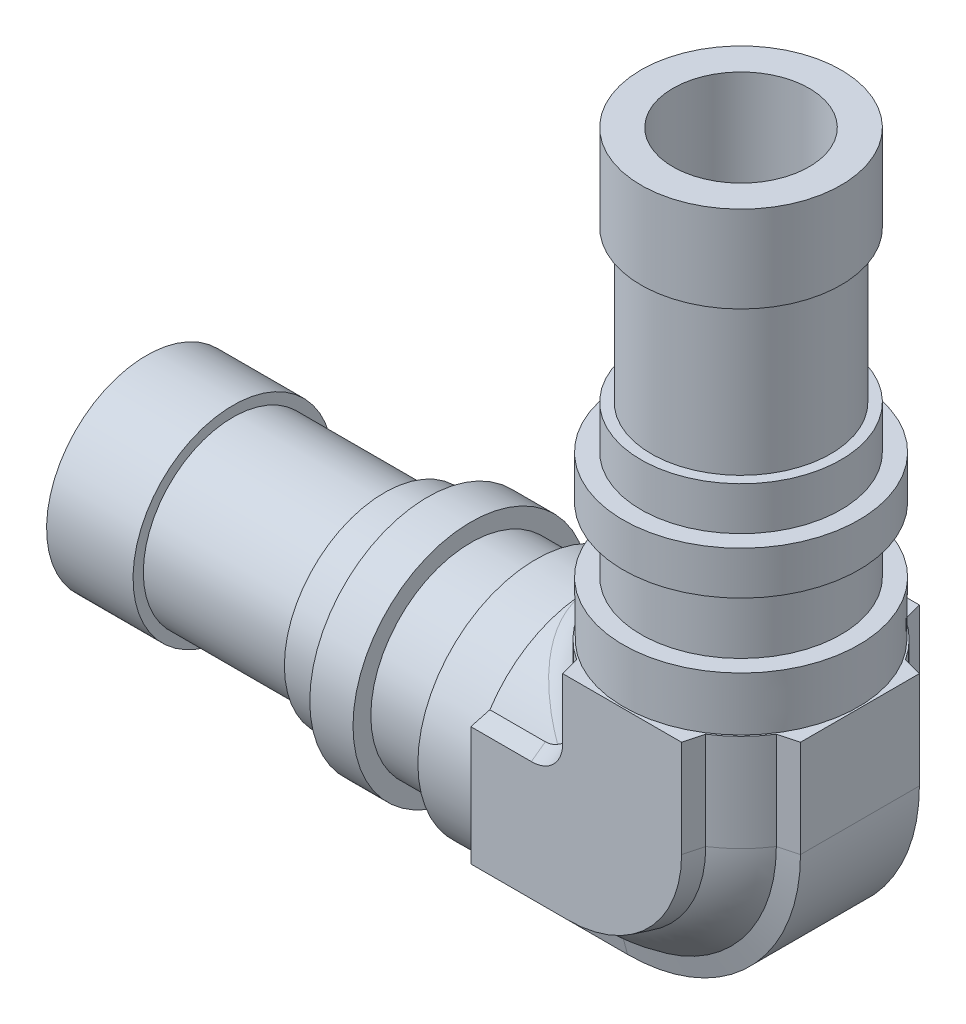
ISO-10303-21;
HEADER;
FILE_DESCRIPTION(('STEP AP214'),'2;1');
FILE_NAME('part.step','',(''),(''),'','','');
FILE_SCHEMA(('AUTOMOTIVE_DESIGN { 1 0 10303 214 1 1 1 1 }'));
ENDSEC;
DATA;
#1=APPLICATION_CONTEXT('core data for automotive mechanical design processes');
#2=APPLICATION_PROTOCOL_DEFINITION('international standard','automotive_design',2000,#1);
#3=PRODUCT_CONTEXT('',#1,'mechanical');
#4=PRODUCT('Part','Part','',(#3));
#5=PRODUCT_RELATED_PRODUCT_CATEGORY('part','',(#4));
#6=PRODUCT_DEFINITION_FORMATION('','',#4);
#7=PRODUCT_DEFINITION_CONTEXT('part definition',#1,'design');
#8=PRODUCT_DEFINITION('design','',#6,#7);
#9=PRODUCT_DEFINITION_SHAPE('','',#8);
#10=(LENGTH_UNIT() NAMED_UNIT(*) SI_UNIT(.MILLI.,.METRE.));
#11=(NAMED_UNIT(*) PLANE_ANGLE_UNIT() SI_UNIT($,.RADIAN.));
#12=(NAMED_UNIT(*) SI_UNIT($,.STERADIAN.) SOLID_ANGLE_UNIT());
#13=UNCERTAINTY_MEASURE_WITH_UNIT(LENGTH_MEASURE(1.E-05),#10,'distance_accuracy_value','');
#14=(GEOMETRIC_REPRESENTATION_CONTEXT(3) GLOBAL_UNCERTAINTY_ASSIGNED_CONTEXT((#13)) GLOBAL_UNIT_ASSIGNED_CONTEXT((#10,
#11,#12)) REPRESENTATION_CONTEXT('',''));
#15=CARTESIAN_POINT('',(0.,0.,0.));
#16=DIRECTION('',(0.,0.,1.));
#17=DIRECTION('',(1.,0.,0.));
#18=AXIS2_PLACEMENT_3D('',#15,#16,#17);
#19=CARTESIAN_POINT('',(-9.02173060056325,-14.3514005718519,-3.94078493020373));
#20=DIRECTION('',(0.,0.258819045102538,0.965925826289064));
#21=DIRECTION('',(0.,-0.965925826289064,0.258819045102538));
#22=AXIS2_PLACEMENT_3D('',#19,#20,#21);
#23=PLANE('',#22);
#24=DIRECTION('',(1.,0.,0.));
#25=VECTOR('',#24,1.);
#26=CARTESIAN_POINT('',(-9.02173060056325,-18.7954704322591,-2.75000000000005));
#27=LINE('',#26,#25);
#28=CARTESIAN_POINT('',(-4.52173060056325,-18.7954704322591,-2.75000000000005));
#29=VERTEX_POINT('',#28);
#30=CARTESIAN_POINT('',(-9.02173060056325,-18.7954704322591,-2.75000000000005));
#31=VERTEX_POINT('',#30);
#32=EDGE_CURVE('E364',#29,#31,#27,.F.);
#33=ORIENTED_EDGE('',*,*,#32,.T.);
#34=DIRECTION('',(0.,-0.965925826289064,0.258819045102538));
#35=VECTOR('',#34,1.);
#36=CARTESIAN_POINT('',(-9.02173060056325,-14.3514005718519,-3.94078493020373));
#37=LINE('',#36,#35);
#38=CARTESIAN_POINT('',(-9.02173060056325,-17.9142433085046,-2.98612409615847));
#39=VERTEX_POINT('',#38);
#40=EDGE_CURVE('E490',#39,#31,#37,.T.);
#41=ORIENTED_EDGE('',*,*,#40,.F.);
#42=DIRECTION('',(1.,0.,0.));
#43=VECTOR('',#42,1.);
#44=CARTESIAN_POINT('',(-9.02173060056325,-17.9142433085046,-2.98612409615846));
#45=LINE('',#44,#43);
#46=CARTESIAN_POINT('',(-4.52173060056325,-17.9142433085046,-2.98612409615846));
#47=VERTEX_POINT('',#46);
#48=EDGE_CURVE('E361',#47,#39,#45,.F.);
#49=ORIENTED_EDGE('',*,*,#48,.F.);
#50=DIRECTION('',(0.,0.965925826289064,-0.258819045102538));
#51=VECTOR('',#50,1.);
#52=CARTESIAN_POINT('',(-4.52173060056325,-18.7954704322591,-2.75000000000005));
#53=LINE('',#52,#51);
#54=EDGE_CURVE('E365',#29,#47,#53,.T.);
#55=ORIENTED_EDGE('',*,*,#54,.F.);
#56=EDGE_LOOP('',(#33,#41,#49,#55));
#57=FACE_BOUND('',#56,.T.);
#58=ADVANCED_FACE('F17',(#57),#23,.F.);
#59=CARTESIAN_POINT('',(-9.02173060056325,-14.3514005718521,3.94078493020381));
#60=DIRECTION('',(0.,0.258819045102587,-0.965925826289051));
#61=DIRECTION('',(0.,0.965925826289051,0.258819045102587));
#62=AXIS2_PLACEMENT_3D('',#59,#60,#61);
#63=PLANE('',#62);
#64=DIRECTION('',(1.,0.,0.));
#65=VECTOR('',#64,1.);
#66=CARTESIAN_POINT('',(-9.02173060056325,-17.9142433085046,2.98612409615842));
#67=LINE('',#66,#65);
#68=CARTESIAN_POINT('',(-9.02173060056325,-17.9142433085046,2.98612409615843));
#69=VERTEX_POINT('',#68);
#70=CARTESIAN_POINT('',(-4.52173060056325,-17.9142433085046,2.98612409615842));
#71=VERTEX_POINT('',#70);
#72=EDGE_CURVE('E356',#69,#71,#67,.T.);
#73=ORIENTED_EDGE('',*,*,#72,.F.);
#74=DIRECTION('',(0.,0.965925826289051,0.258819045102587));
#75=VECTOR('',#74,1.);
#76=CARTESIAN_POINT('',(-9.02173060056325,-14.3514005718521,3.94078493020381));
#77=LINE('',#76,#75);
#78=CARTESIAN_POINT('',(-9.02173060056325,-18.795470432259,2.74999999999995));
#79=VERTEX_POINT('',#78);
#80=EDGE_CURVE('E486',#79,#69,#77,.T.);
#81=ORIENTED_EDGE('',*,*,#80,.F.);
#82=DIRECTION('',(1.,0.,0.));
#83=VECTOR('',#82,1.);
#84=CARTESIAN_POINT('',(-9.02173060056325,-18.795470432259,2.74999999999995));
#85=LINE('',#84,#83);
#86=CARTESIAN_POINT('',(-4.52173060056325,-18.7954704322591,2.74999999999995));
#87=VERTEX_POINT('',#86);
#88=EDGE_CURVE('E358',#79,#87,#85,.T.);
#89=ORIENTED_EDGE('',*,*,#88,.T.);
#90=DIRECTION('',(0.,0.965925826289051,0.258819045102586));
#91=VECTOR('',#90,1.);
#92=CARTESIAN_POINT('',(-4.52173060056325,-18.795470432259,2.74999999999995));
#93=LINE('',#92,#91);
#94=EDGE_CURVE('E455',#71,#87,#93,.F.);
#95=ORIENTED_EDGE('',*,*,#94,.F.);
#96=EDGE_LOOP('',(#73,#81,#89,#95));
#97=FACE_BOUND('',#96,.T.);
#98=ADVANCED_FACE('F1499',(#97),#63,.F.);
#99=CARTESIAN_POINT('',(-4.52173060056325,-10.7954704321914,2.74999999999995));
#100=DIRECTION('',(0.,0.,-1.));
#101=DIRECTION('',(-1.,0.,0.));
#102=AXIS2_PLACEMENT_3D('',#99,#100,#101);
#103=CONICAL_SURFACE('',#102,8.00000000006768,1.30899693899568);
#104=CARTESIAN_POINT('',(-4.52173060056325,-10.7954704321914,2.98612409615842));
#105=DIRECTION('',(0.,0.,-1.));
#106=DIRECTION('',(-1.,0.,0.));
#107=AXIS2_PLACEMENT_3D('',#104,#105,#106);
#108=CIRCLE('',#107,7.1187728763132);
#109=CARTESIAN_POINT('',(2.59704227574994,-10.7954704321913,2.98612409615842));
#110=VERTEX_POINT('',#109);
#111=EDGE_CURVE('E834',#71,#110,#108,.F.);
#112=ORIENTED_EDGE('',*,*,#111,.F.);
#113=ORIENTED_EDGE('',*,*,#94,.T.);
#114=CARTESIAN_POINT('',(-4.52173060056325,-10.7954704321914,2.74999999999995));
#115=DIRECTION('',(0.,0.,-1.));
#116=DIRECTION('',(-1.,0.,0.));
#117=AXIS2_PLACEMENT_3D('',#114,#115,#116);
#118=CIRCLE('',#117,8.00000000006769);
#119=CARTESIAN_POINT('',(3.47826939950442,-10.7954704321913,2.74999999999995));
#120=VERTEX_POINT('',#119);
#121=EDGE_CURVE('E466',#120,#87,#118,.T.);
#122=ORIENTED_EDGE('',*,*,#121,.F.);
#123=DIRECTION('',(-0.965925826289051,0.,0.258819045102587));
#124=VECTOR('',#123,1.);
#125=CARTESIAN_POINT('',(-3.29833221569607,-10.7954704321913,4.56578493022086));
#126=LINE('',#125,#124);
#127=EDGE_CURVE('E506',#120,#110,#126,.T.);
#128=ORIENTED_EDGE('',*,*,#127,.T.);
#129=EDGE_LOOP('',(#112,#113,#122,#128));
#130=FACE_BOUND('',#129,.T.);
#131=ADVANCED_FACE('F967',(#130),#103,.T.);
#132=CARTESIAN_POINT('',(-4.52173060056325,-10.7954704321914,-2.75000000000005));
#133=DIRECTION('',(0.,0.,1.));
#134=DIRECTION('',(1.,0.,0.));
#135=AXIS2_PLACEMENT_3D('',#132,#133,#134);
#136=CONICAL_SURFACE('',#135,8.0000000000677,1.30899693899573);
#137=CARTESIAN_POINT('',(-4.52173060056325,-10.7954704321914,-2.75000000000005));
#138=DIRECTION('',(0.,0.,-1.));
#139=DIRECTION('',(-1.,0.,0.));
#140=AXIS2_PLACEMENT_3D('',#137,#138,#139);
#141=CIRCLE('',#140,8.00000000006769);
#142=CARTESIAN_POINT('',(3.47826939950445,-10.7954704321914,-2.75000000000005));
#143=VERTEX_POINT('',#142);
#144=EDGE_CURVE('E470',#29,#143,#141,.F.);
#145=ORIENTED_EDGE('',*,*,#144,.F.);
#146=ORIENTED_EDGE('',*,*,#54,.T.);
#147=CARTESIAN_POINT('',(-4.52173060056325,-10.7954704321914,-2.98612409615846));
#148=DIRECTION('',(0.,0.,-1.));
#149=DIRECTION('',(-1.,0.,0.));
#150=AXIS2_PLACEMENT_3D('',#147,#148,#149);
#151=CIRCLE('',#150,7.11877287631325);
#152=CARTESIAN_POINT('',(2.59704227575,-10.7954704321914,-2.98612409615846));
#153=VERTEX_POINT('',#152);
#154=EDGE_CURVE('E436',#153,#47,#151,.T.);
#155=ORIENTED_EDGE('',*,*,#154,.F.);
#156=DIRECTION('',(-0.965925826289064,0.,-0.258819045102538));
#157=VECTOR('',#156,1.);
#158=CARTESIAN_POINT('',(3.47826939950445,-10.7954704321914,-2.75000000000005));
#159=LINE('',#158,#157);
#160=EDGE_CURVE('E453',#153,#143,#159,.F.);
#161=ORIENTED_EDGE('',*,*,#160,.T.);
#162=EDGE_LOOP('',(#145,#146,#155,#161));
#163=FACE_BOUND('',#162,.T.);
#164=ADVANCED_FACE('F1482',(#163),#136,.T.);
#165=CARTESIAN_POINT('',(-9.02173060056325,-13.295470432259,0.));
#166=DIRECTION('',(1.,0.,0.));
#167=DIRECTION('',(0.,0.,-1.));
#168=AXIS2_PLACEMENT_3D('',#165,#166,#167);
#169=CYLINDRICAL_SURFACE('',#168,5.50000000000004);
#170=CARTESIAN_POINT('',(-9.02173060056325,-13.295470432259,0.));
#171=DIRECTION('',(1.,0.,0.));
#172=DIRECTION('',(0.,0.,-1.));
#173=AXIS2_PLACEMENT_3D('',#170,#171,#172);
#174=CIRCLE('',#173,5.50000000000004);
#175=CARTESIAN_POINT('',(-9.02173060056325,-16.2815945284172,-4.61877287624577));
#176=VERTEX_POINT('',#175);
#177=EDGE_CURVE('E517',#176,#39,#174,.F.);
#178=ORIENTED_EDGE('',*,*,#177,.F.);
#179=DIRECTION('',(1.,0.,0.));
#180=VECTOR('',#179,1.);
#181=CARTESIAN_POINT('',(-9.02173060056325,-16.2815945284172,-4.61877287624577));
#182=LINE('',#181,#180);
#183=CARTESIAN_POINT('',(-4.52173060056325,-16.2815945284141,-4.61877287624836));
#184=VERTEX_POINT('',#183);
#185=EDGE_CURVE('E368',#176,#184,#182,.T.);
#186=ORIENTED_EDGE('',*,*,#185,.T.);
#187=CARTESIAN_POINT('',(-4.52173060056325,-13.295470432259,0.));
#188=DIRECTION('',(-1.,0.,0.));
#189=DIRECTION('',(0.,-1.,0.));
#190=AXIS2_PLACEMENT_3D('',#187,#188,#189);
#191=CIRCLE('',#190,5.50000000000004);
#192=EDGE_CURVE('E434',#47,#184,#191,.F.);
#193=ORIENTED_EDGE('',*,*,#192,.F.);
#194=ORIENTED_EDGE('',*,*,#48,.T.);
#195=EDGE_LOOP('',(#178,#186,#193,#194));
#196=FACE_BOUND('',#195,.T.);
#197=ADVANCED_FACE('F1473',(#196),#169,.T.);
#198=CARTESIAN_POINT('',(-9.02173060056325,-18.7954704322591,0.));
#199=DIRECTION('',(0.,1.,0.));
#200=DIRECTION('',(0.,0.,1.));
#201=AXIS2_PLACEMENT_3D('',#198,#199,#200);
#202=PLANE('',#201);
#203=ORIENTED_EDGE('',*,*,#88,.F.);
#204=DIRECTION('',(0.,0.,1.));
#205=VECTOR('',#204,1.);
#206=CARTESIAN_POINT('',(-9.02173060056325,-18.7954704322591,0.));
#207=LINE('',#206,#205);
#208=EDGE_CURVE('E513',#31,#79,#207,.T.);
#209=ORIENTED_EDGE('',*,*,#208,.F.);
#210=ORIENTED_EDGE('',*,*,#32,.F.);
#211=DIRECTION('',(0.,0.,-1.));
#212=VECTOR('',#211,1.);
#213=CARTESIAN_POINT('',(-4.52173060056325,-18.7954704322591,8.49999999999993));
#214=LINE('',#213,#212);
#215=EDGE_CURVE('E469',#87,#29,#214,.T.);
#216=ORIENTED_EDGE('',*,*,#215,.F.);
#217=EDGE_LOOP('',(#203,#209,#210,#216));
#218=FACE_BOUND('',#217,.T.);
#219=ADVANCED_FACE('F1465',(#218),#202,.F.);
#220=CARTESIAN_POINT('',(-9.02173060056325,-13.295470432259,0.));
#221=DIRECTION('',(1.,0.,0.));
#222=DIRECTION('',(0.,0.,-1.));
#223=AXIS2_PLACEMENT_3D('',#220,#221,#222);
#224=CYLINDRICAL_SURFACE('',#223,5.49999999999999);
#225=CARTESIAN_POINT('',(-9.02173060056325,-13.295470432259,0.));
#226=DIRECTION('',(1.,0.,0.));
#227=DIRECTION('',(0.,0.,-1.));
#228=AXIS2_PLACEMENT_3D('',#225,#226,#227);
#229=CIRCLE('',#228,5.49999999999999);
#230=CARTESIAN_POINT('',(-9.02173060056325,-16.2815945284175,4.61877287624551));
#231=VERTEX_POINT('',#230);
#232=EDGE_CURVE('E516',#69,#231,#229,.F.);
#233=ORIENTED_EDGE('',*,*,#232,.F.);
#234=ORIENTED_EDGE('',*,*,#72,.T.);
#235=CARTESIAN_POINT('',(-4.52173060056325,-13.295470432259,0.));
#236=DIRECTION('',(-1.,0.,0.));
#237=DIRECTION('',(0.,-1.,0.));
#238=AXIS2_PLACEMENT_3D('',#235,#236,#237);
#239=CIRCLE('',#238,5.49999999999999);
#240=CARTESIAN_POINT('',(-4.52173060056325,-16.2815945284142,4.61877287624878));
#241=VERTEX_POINT('',#240);
#242=EDGE_CURVE('E478',#241,#71,#239,.F.);
#243=ORIENTED_EDGE('',*,*,#242,.F.);
#244=DIRECTION('',(1.,0.,0.));
#245=VECTOR('',#244,1.);
#246=CARTESIAN_POINT('',(-9.02173060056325,-16.2815945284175,4.61877287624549));
#247=LINE('',#246,#245);
#248=EDGE_CURVE('E350',#241,#231,#247,.F.);
#249=ORIENTED_EDGE('',*,*,#248,.T.);
#250=EDGE_LOOP('',(#233,#234,#243,#249));
#251=FACE_BOUND('',#250,.T.);
#252=ADVANCED_FACE('F1458',(#251),#224,.T.);
#253=CARTESIAN_POINT('',(-9.02173060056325,-13.295470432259,0.));
#254=DIRECTION('',(1.,0.,0.));
#255=DIRECTION('',(0.,0.,-1.));
#256=AXIS2_PLACEMENT_3D('',#253,#254,#255);
#257=CYLINDRICAL_SURFACE('',#256,5.5);
#258=CARTESIAN_POINT('',(-9.02173060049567,-7.79547043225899,-1.72746251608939E-13));
#259=CARTESIAN_POINT('',(-9.0217315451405,-7.79546969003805,0.044599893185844));
#260=CARTESIAN_POINT('',(-9.0210366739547,-7.79601566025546,0.0891993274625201));
#261=CARTESIAN_POINT('',(-9.0182649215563,-7.79819346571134,0.178371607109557));
#262=CARTESIAN_POINT('',(-9.01618671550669,-7.79982634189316,0.222944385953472));
#263=CARTESIAN_POINT('',(-9.01065266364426,-7.80417452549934,0.312037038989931));
#264=CARTESIAN_POINT('',(-9.00719418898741,-7.806891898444,0.356556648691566));
#265=CARTESIAN_POINT('',(-8.99890533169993,-7.81340457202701,0.445517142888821));
#266=CARTESIAN_POINT('',(-8.99407107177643,-7.81720291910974,0.489957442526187));
#267=CARTESIAN_POINT('',(-8.98303593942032,-7.82587338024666,0.578733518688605));
#268=CARTESIAN_POINT('',(-8.97683000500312,-7.83074947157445,0.623068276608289));
#269=CARTESIAN_POINT('',(-8.96305685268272,-7.84157123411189,0.711607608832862));
#270=CARTESIAN_POINT('',(-8.95548346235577,-7.84752175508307,0.755810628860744));
#271=CARTESIAN_POINT('',(-8.93898061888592,-7.86048827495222,0.844060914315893));
#272=CARTESIAN_POINT('',(-8.93004396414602,-7.86750993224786,0.88810599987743));
#273=CARTESIAN_POINT('',(-8.91081974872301,-7.88261467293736,0.976014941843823));
#274=CARTESIAN_POINT('',(-8.90052404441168,-7.89070415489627,1.01987591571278));
#275=CARTESIAN_POINT('',(-8.87858674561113,-7.90794060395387,1.10739120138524));
#276=CARTESIAN_POINT('',(-8.8669361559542,-7.91709463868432,1.15104186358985));
#277=CARTESIAN_POINT('',(-8.84229419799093,-7.93645617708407,1.23811127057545));
#278=CARTESIAN_POINT('',(-8.82929307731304,-7.94667134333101,1.28152554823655));
#279=CARTESIAN_POINT('',(-8.80195454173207,-7.96815162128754,1.3680959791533));
#280=CARTESIAN_POINT('',(-8.78760672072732,-7.97942490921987,1.41124681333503));
#281=CARTESIAN_POINT('',(-8.75758645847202,-8.0030122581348,1.49726585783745));
#282=CARTESIAN_POINT('',(-8.74190316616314,-8.01533484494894,1.54012793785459));
#283=CARTESIAN_POINT('',(-8.70922481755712,-8.04101069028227,1.62554589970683));
#284=CARTESIAN_POINT('',(-8.69221858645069,-8.05437272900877,1.66809486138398));
#285=CARTESIAN_POINT('',(-8.6569067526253,-8.08211774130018,1.75286279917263));
#286=CARTESIAN_POINT('',(-8.63858975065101,-8.09650967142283,1.79507408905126));
#287=CARTESIAN_POINT('',(-8.60066876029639,-8.1263047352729,1.87914292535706));
#288=CARTESIAN_POINT('',(-8.5810532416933,-8.14171692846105,1.92099205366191));
#289=CARTESIAN_POINT('',(-8.54054749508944,-8.17354287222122,2.00431275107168));
#290=CARTESIAN_POINT('',(-8.51964568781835,-8.18996572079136,2.04577520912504));
#291=CARTESIAN_POINT('',(-8.4765795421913,-8.22380340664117,2.12829873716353));
#292=CARTESIAN_POINT('',(-8.45440364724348,-8.24122732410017,2.16935004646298));
#293=CARTESIAN_POINT('',(-8.40880153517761,-8.27705755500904,2.25102731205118));
#294=CARTESIAN_POINT('',(-8.38536384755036,-8.29547288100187,2.2916429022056));
#295=CARTESIAN_POINT('',(-8.33724991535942,-8.33327668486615,2.37242506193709));
#296=CARTESIAN_POINT('',(-8.31256233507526,-8.35267406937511,2.41258071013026));
#297=CARTESIAN_POINT('',(-8.2619617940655,-8.39243163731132,2.49241796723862));
#298=CARTESIAN_POINT('',(-8.2360376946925,-8.41280057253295,2.53208813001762));
#299=CARTESIAN_POINT('',(-8.15595804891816,-8.47572029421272,2.65107154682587));
#300=CARTESIAN_POINT('',(-8.10039058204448,-8.51938044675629,2.72885780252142));
#301=CARTESIAN_POINT('',(-7.98459078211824,-8.61036600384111,2.88230265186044));
#302=CARTESIAN_POINT('',(-7.92427725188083,-8.65775520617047,2.95786161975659));
#303=CARTESIAN_POINT('',(-7.79913086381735,-8.75608451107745,3.1066929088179));
#304=CARTESIAN_POINT('',(-7.73422343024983,-8.8070832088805,3.17986364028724));
#305=CARTESIAN_POINT('',(-7.60003882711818,-8.91251396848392,3.32374626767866));
#306=CARTESIAN_POINT('',(-7.53069390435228,-8.96699926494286,3.39435572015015));
#307=CARTESIAN_POINT('',(-7.38778340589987,-9.07928608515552,3.53294692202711));
#308=CARTESIAN_POINT('',(-7.31415672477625,-9.13713562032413,3.60082656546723));
#309=CARTESIAN_POINT('',(-7.16283257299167,-9.25603316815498,3.7337786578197));
#310=CARTESIAN_POINT('',(-7.08508036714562,-9.31712418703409,3.79875014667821));
#311=CARTESIAN_POINT('',(-6.92569358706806,-9.44235665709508,3.92573724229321));
#312=CARTESIAN_POINT('',(-6.84401116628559,-9.50653570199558,3.98765551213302));
#313=CARTESIAN_POINT('',(-6.67696017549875,-9.63779005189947,4.10839972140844));
#314=CARTESIAN_POINT('',(-6.59155019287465,-9.7048978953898,4.16713282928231));
#315=CARTESIAN_POINT('',(-6.41724133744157,-9.84185485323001,4.28136790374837));
#316=CARTESIAN_POINT('',(-6.32830685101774,-9.91173194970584,4.3367817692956));
#317=CARTESIAN_POINT('',(-6.14713815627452,-10.0540787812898,4.44423413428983));
#318=CARTESIAN_POINT('',(-6.05487334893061,-10.1265725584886,4.49618928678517));
#319=CARTESIAN_POINT('',(-5.9618941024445,-10.1996276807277,4.54595584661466));
#320=B_SPLINE_CURVE_WITH_KNOTS('',3,(#258,#259,#260,#261,#262,#263,#264,#265,#266,#267,#268,
#269,#270,#271,#272,#273,#274,#275,#276,#277,#278,#279,#280,#281,#282,#283,#284,#285,#286,#287,
#288,#289,#290,#291,#292,#293,#294,#295,#296,#297,#298,#299,#300,#301,#302,#303,#304,#305,#306,
#307,#308,#309,#310,#311,#312,#313,#314,#315,#316,#317,#318,#319),.UNSPECIFIED.,.F.,.F.,(4,2,2,
2,2,2,2,2,2,2,2,2,2,2,2,2,2,2,2,2,2,2,2,2,2,2,2,2,2,2,4),(0.,0.133790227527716,
0.267708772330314,0.401883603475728,0.536440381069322,0.671502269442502,0.807189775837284,
0.943620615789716,1.0809096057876,1.2191685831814,1.35850635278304,1.4990268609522,
1.64082414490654,1.78398650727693,1.92859636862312,2.07473045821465,2.2224600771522,
2.37185137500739,2.52296563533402,2.67585956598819,2.83058559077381,3.14567833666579,
3.46853358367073,3.79931023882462,4.13809653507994,4.48492163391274,4.83975212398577,
5.20244135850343,5.57278440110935,5.95053330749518,6.33540495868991),.UNSPECIFIED.);
#321=CARTESIAN_POINT('',(-5.96189485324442,-10.1996270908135,4.54595781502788));
#322=VERTEX_POINT('',#321);
#323=CARTESIAN_POINT('',(-9.02173060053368,-7.79547043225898,0.));
#324=VERTEX_POINT('',#323);
#325=EDGE_CURVE('E338',#322,#324,#320,.F.);
#326=ORIENTED_EDGE('',*,*,#325,.T.);
#327=CARTESIAN_POINT('',(-9.02173060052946,-13.295470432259,0.));
#328=DIRECTION('',(1.,0.,0.));
#329=DIRECTION('',(0.,0.,-1.));
#330=AXIS2_PLACEMENT_3D('',#327,#328,#329);
#331=CIRCLE('',#330,5.5);
#332=CARTESIAN_POINT('',(-9.02173060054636,-10.3093463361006,4.6187728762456));
#333=VERTEX_POINT('',#332);
#334=EDGE_CURVE('E738',#333,#324,#331,.F.);
#335=ORIENTED_EDGE('',*,*,#334,.F.);
#336=DIRECTION('',(1.,0.,0.));
#337=VECTOR('',#336,1.);
#338=CARTESIAN_POINT('',(-9.02173060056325,-10.3093463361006,4.61877287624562));
#339=LINE('',#338,#337);
#340=CARTESIAN_POINT('',(-6.45674343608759,-10.3093463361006,4.6187728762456));
#341=VERTEX_POINT('',#340);
#342=EDGE_CURVE('E222',#333,#341,#339,.T.);
#343=ORIENTED_EDGE('',*,*,#342,.T.);
#344=CARTESIAN_POINT('',(-6.45674343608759,-10.3093463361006,4.61877287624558));
#345=CARTESIAN_POINT('',(-6.42910592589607,-10.3093462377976,4.61877152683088));
#346=CARTESIAN_POINT('',(-6.40147851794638,-10.308448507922,4.61819256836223));
#347=CARTESIAN_POINT('',(-6.34637625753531,-10.3047923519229,4.61582620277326));
#348=CARTESIAN_POINT('',(-6.31890155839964,-10.3020323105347,4.61403774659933));
#349=CARTESIAN_POINT('',(-6.23827227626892,-10.2910391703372,4.60689428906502));
#350=CARTESIAN_POINT('',(-6.18558663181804,-10.2800970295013,4.59976472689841));
#351=CARTESIAN_POINT('',(-6.10463990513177,-10.2570248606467,4.58453355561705));
#352=CARTESIAN_POINT('',(-6.075350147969,-10.2472902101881,4.57807523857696));
#353=CARTESIAN_POINT('',(-6.01771859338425,-10.2253175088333,4.56336881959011));
#354=CARTESIAN_POINT('',(-5.98939471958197,-10.2130477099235,4.55509792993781));
#355=CARTESIAN_POINT('',(-5.96189477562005,-10.1996260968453,4.54595950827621));
#356=B_SPLINE_CURVE_WITH_KNOTS('',3,(#344,#345,#346,#347,#348,#349,#350,#351,#352,#353,#354,
#355),.UNSPECIFIED.,.F.,.F.,(4,2,2,2,2,4),(0.,0.0828676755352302,0.165807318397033,
0.327754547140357,0.422212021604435,0.517933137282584),.UNSPECIFIED.);
#357=EDGE_CURVE('E223',#341,#322,#356,.T.);
#358=ORIENTED_EDGE('',*,*,#357,.T.);
#359=EDGE_LOOP('',(#326,#335,#343,#358));
#360=FACE_BOUND('',#359,.T.);
#361=ADVANCED_FACE('F314',(#360),#257,.T.);
#362=CARTESIAN_POINT('',(-9.02173060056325,-13.295470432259,0.));
#363=DIRECTION('',(1.,0.,0.));
#364=DIRECTION('',(0.,0.,-1.));
#365=AXIS2_PLACEMENT_3D('',#362,#363,#364);
#366=CYLINDRICAL_SURFACE('',#365,5.5);
#367=DIRECTION('',(1.,0.,0.));
#368=VECTOR('',#367,1.);
#369=CARTESIAN_POINT('',(-9.02173060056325,-10.3093463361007,-4.61877287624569));
#370=LINE('',#369,#368);
#371=CARTESIAN_POINT('',(-9.02173060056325,-10.3093463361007,-4.6187728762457));
#372=VERTEX_POINT('',#371);
#373=CARTESIAN_POINT('',(-6.4567434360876,-10.3093463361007,-4.6187728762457));
#374=VERTEX_POINT('',#373);
#375=EDGE_CURVE('E375',#372,#374,#370,.T.);
#376=ORIENTED_EDGE('',*,*,#375,.F.);
#377=CARTESIAN_POINT('',(-9.02173060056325,-13.295470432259,0.));
#378=DIRECTION('',(1.,0.,0.));
#379=DIRECTION('',(0.,0.,-1.));
#380=AXIS2_PLACEMENT_3D('',#377,#378,#379);
#381=CIRCLE('',#380,5.5);
#382=EDGE_CURVE('E735',#324,#372,#381,.F.);
#383=ORIENTED_EDGE('',*,*,#382,.F.);
#384=CARTESIAN_POINT('',(-5.85432369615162,-10.2841472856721,-4.60238339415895));
#385=CARTESIAN_POINT('',(-6.33831426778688,-9.90386897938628,-4.35356864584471));
#386=CARTESIAN_POINT('',(-6.78272785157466,-9.55468687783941,-4.05746385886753));
#387=CARTESIAN_POINT('',(-7.56566852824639,-8.9395192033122,-3.38853411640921));
#388=CARTESIAN_POINT('',(-7.9040928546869,-8.67361437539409,-3.01577869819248));
#389=CARTESIAN_POINT('',(-8.45424972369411,-8.24134826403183,-2.21637624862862));
#390=CARTESIAN_POINT('',(-8.66594776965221,-8.07501408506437,-1.78977934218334));
#391=CARTESIAN_POINT('',(-8.94969710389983,-7.85206817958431,-0.908760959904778));
#392=CARTESIAN_POINT('',(-9.02173060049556,-7.79547043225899,-0.454394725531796));
#393=CARTESIAN_POINT('',(-9.02173060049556,-7.79547043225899,0.454394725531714));
#394=CARTESIAN_POINT('',(-8.94969710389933,-7.85206817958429,0.908760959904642));
#395=CARTESIAN_POINT('',(-8.66594776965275,-8.07501408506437,1.78977934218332));
#396=CARTESIAN_POINT('',(-8.45424972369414,-8.24134826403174,2.21637624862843));
#397=CARTESIAN_POINT('',(-7.90409285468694,-8.67361437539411,3.01577869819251));
#398=CARTESIAN_POINT('',(-7.56566852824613,-8.93951920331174,3.38853411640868));
#399=CARTESIAN_POINT('',(-6.782727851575,-9.5546868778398,4.05746385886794));
#400=CARTESIAN_POINT('',(-6.3383142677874,-9.90386897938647,4.35356864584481));
#401=CARTESIAN_POINT('',(-5.85432369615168,-10.284147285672,4.6023833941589));
#402=(BOUNDED_CURVE() B_SPLINE_CURVE(3,(#384,#385,#386,#387,#388,#389,#390,#391,#392,#393,#394,
#395,#396,#397,#398,#399,#400,#401),.UNSPECIFIED.,.F.,.F.) B_SPLINE_CURVE_WITH_KNOTS((4,2,2,2,2,
2,2,2,4),(2.15018597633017,2.39803764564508,2.64588931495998,2.89374098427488,3.14159265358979,
3.38944432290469,3.6372959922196,3.8851476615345,4.1329993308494),
.UNSPECIFIED.) CURVE() GEOMETRIC_REPRESENTATION_ITEM() RATIONAL_B_SPLINE_CURVE((0.999999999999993,
0.999999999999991,0.999999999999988,0.999999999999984,0.999999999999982,0.999999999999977,
0.999999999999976,0.999999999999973,0.999999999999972,0.999999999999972,0.999999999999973,
0.999999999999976,0.999999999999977,0.999999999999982,0.999999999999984,0.999999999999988,
0.999999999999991,0.999999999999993)) REPRESENTATION_ITEM(''));
#403=CARTESIAN_POINT('',(-5.96189485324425,-10.1996270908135,-4.54595781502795));
#404=VERTEX_POINT('',#403);
#405=EDGE_CURVE('E381',#324,#404,#402,.F.);
#406=ORIENTED_EDGE('',*,*,#405,.T.);
#407=CARTESIAN_POINT('',(-5.96189477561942,-10.1996260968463,-4.54595950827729));
#408=CARTESIAN_POINT('',(-5.98569130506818,-10.2112360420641,-4.55386519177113));
#409=CARTESIAN_POINT('',(-6.01010158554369,-10.2219881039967,-4.56112335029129));
#410=CARTESIAN_POINT('',(-6.0599740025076,-10.241691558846,-4.57433888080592));
#411=CARTESIAN_POINT('',(-6.08543598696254,-10.2506432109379,-4.58029644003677));
#412=CARTESIAN_POINT('',(-6.1619659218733,-10.2743097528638,-4.59597091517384));
#413=CARTESIAN_POINT('',(-6.21427902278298,-10.2863710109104,-4.60384901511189));
#414=CARTESIAN_POINT('',(-6.29835774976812,-10.2996404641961,-4.61248673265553));
#415=CARTESIAN_POINT('',(-6.32962471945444,-10.3032760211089,-4.61484412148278));
#416=CARTESIAN_POINT('',(-6.39283702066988,-10.3081460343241,-4.61799697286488));
#417=CARTESIAN_POINT('',(-6.42478587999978,-10.3093485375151,-4.61877165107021));
#418=CARTESIAN_POINT('',(-6.45674343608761,-10.3093463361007,-4.61877287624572));
#419=B_SPLINE_CURVE_WITH_KNOTS('',3,(#407,#408,#409,#410,#411,#412,#413,#414,#415,#416,#417,
#418),.UNSPECIFIED.,.F.,.F.,(4,2,2,2,2,4),(0.,0.082836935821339,0.165661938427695,
0.32753651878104,0.422118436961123,0.517934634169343),.UNSPECIFIED.);
#420=EDGE_CURVE('E309',#404,#374,#419,.T.);
#421=ORIENTED_EDGE('',*,*,#420,.T.);
#422=EDGE_LOOP('',(#376,#383,#406,#421));
#423=FACE_BOUND('',#422,.T.);
#424=ADVANCED_FACE('F311',(#423),#366,.T.);
#425=CARTESIAN_POINT('',(-7.66945762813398,-7.64774340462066,0.481090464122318));
#426=DIRECTION('',(0.250562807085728,-0.250562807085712,0.935113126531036));
#427=DIRECTION('',(0.96592582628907,0.,-0.258819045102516));
#428=AXIS2_PLACEMENT_3D('',#425,#426,#427);
#429=CYLINDRICAL_SURFACE('',#428,1.5);
#430=CARTESIAN_POINT('',(-5.11757493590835,-9.35530625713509,4.54595950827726));
#431=CARTESIAN_POINT('',(-5.1059649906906,-9.33150972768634,4.5538651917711));
#432=CARTESIAN_POINT('',(-5.09521292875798,-9.30709944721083,4.56112335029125));
#433=CARTESIAN_POINT('',(-5.07550947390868,-9.25722703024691,4.57433888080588));
#434=CARTESIAN_POINT('',(-5.06655782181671,-9.23176504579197,4.58029644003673));
#435=CARTESIAN_POINT('',(-5.04289127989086,-9.15523511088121,4.5959709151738));
#436=CARTESIAN_POINT('',(-5.03083002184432,-9.10292200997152,4.60384901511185));
#437=CARTESIAN_POINT('',(-5.01756056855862,-9.0188432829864,4.61248673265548));
#438=CARTESIAN_POINT('',(-5.01392501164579,-8.98757631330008,4.61484412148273));
#439=CARTESIAN_POINT('',(-5.00905499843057,-8.92436401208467,4.61799697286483));
#440=CARTESIAN_POINT('',(-5.00785249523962,-8.89241515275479,4.61877165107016));
#441=CARTESIAN_POINT('',(-5.00785469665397,-8.86045759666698,4.61877287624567));
#442=B_SPLINE_CURVE_WITH_KNOTS('',3,(#430,#431,#432,#433,#434,#435,#436,#437,#438,#439,#440,
#441),.UNSPECIFIED.,.F.,.F.,(4,2,2,2,2,4),(0.,0.0828369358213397,0.165661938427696,
0.327536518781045,0.422118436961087,0.517934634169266),.UNSPECIFIED.);
#443=CARTESIAN_POINT('',(-5.11757394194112,-9.35530617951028,4.54595781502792));
#444=VERTEX_POINT('',#443);
#445=CARTESIAN_POINT('',(-5.00785469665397,-8.86045759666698,4.61877287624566));
#446=VERTEX_POINT('',#445);
#447=EDGE_CURVE('E209',#444,#446,#442,.T.);
#448=ORIENTED_EDGE('',*,*,#447,.F.);
#449=CARTESIAN_POINT('',(-5.1175760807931,-9.35530386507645,4.54595398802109));
#450=CARTESIAN_POINT('',(-5.14409819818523,-9.40973407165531,4.52785504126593));
#451=CARTESIAN_POINT('',(-5.17386625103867,-9.46342843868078,4.51231393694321));
#452=CARTESIAN_POINT('',(-5.23939377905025,-9.56843564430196,4.48664614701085));
#453=CARTESIAN_POINT('',(-5.27515611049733,-9.61974733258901,4.4765220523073));
#454=CARTESIAN_POINT('',(-5.36134979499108,-9.73089463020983,4.46026931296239));
#455=CARTESIAN_POINT('',(-5.41324400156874,-9.78983475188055,4.45567483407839));
#456=CARTESIAN_POINT('',(-5.52395924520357,-9.90082126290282,4.45549800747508));
#457=CARTESIAN_POINT('',(-5.58278044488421,-9.95286749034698,4.45991587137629));
#458=CARTESIAN_POINT('',(-5.69434810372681,-10.0398272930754,4.47594392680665));
#459=CARTESIAN_POINT('',(-5.74623353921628,-10.0761328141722,4.48608835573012));
#460=CARTESIAN_POINT('',(-5.85246131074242,-10.1426080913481,4.51193415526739));
#461=CARTESIAN_POINT('',(-5.90680257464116,-10.1727804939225,4.52763312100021));
#462=CARTESIAN_POINT('',(-5.96189716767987,-10.1996249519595,4.54595398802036));
#463=B_SPLINE_CURVE_WITH_KNOTS('',3,(#449,#450,#451,#452,#453,#454,#455,#456,#457,#458,#459,
#460,#461,#462),.UNSPECIFIED.,.F.,.F.,(4,2,2,2,2,2,4),(0.,0.189436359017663,0.37896324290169,
0.613807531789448,0.848657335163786,1.04048652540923,1.23223276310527),.UNSPECIFIED.);
#464=EDGE_CURVE('E752',#444,#322,#463,.T.);
#465=ORIENTED_EDGE('',*,*,#464,.T.);
#466=ORIENTED_EDGE('',*,*,#357,.F.);
#467=DIRECTION('',(0.250562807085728,-0.250562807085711,0.935113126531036));
#468=VECTOR('',#467,1.);
#469=CARTESIAN_POINT('',(-6.45674343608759,-10.3093463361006,4.61877287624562));
#470=LINE('',#469,#468);
#471=CARTESIAN_POINT('',(-6.22061933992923,-10.5454704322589,5.49999999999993));
#472=VERTEX_POINT('',#471);
#473=EDGE_CURVE('E349',#341,#472,#470,.T.);
#474=ORIENTED_EDGE('',*,*,#473,.T.);
#475=CARTESIAN_POINT('',(-6.32464487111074,-8.99255616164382,5.49999999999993));
#476=DIRECTION('',(0.,0.,1.));
#477=DIRECTION('',(0.707106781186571,-0.707106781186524,0.));
#478=AXIS2_PLACEMENT_3D('',#475,#476,#477);
#479=ELLIPSE('',#478,1.60408399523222,1.5);
#480=CARTESIAN_POINT('',(-4.77173060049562,-9.09658169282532,5.49999999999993));
#481=VERTEX_POINT('',#480);
#482=EDGE_CURVE('E229',#481,#472,#479,.F.);
#483=ORIENTED_EDGE('',*,*,#482,.F.);
#484=DIRECTION('',(0.250562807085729,-0.250562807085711,0.935113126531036));
#485=VECTOR('',#484,1.);
#486=CARTESIAN_POINT('',(-5.00785469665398,-8.86045759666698,4.61877287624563));
#487=LINE('',#486,#485);
#488=EDGE_CURVE('E226',#446,#481,#487,.T.);
#489=ORIENTED_EDGE('',*,*,#488,.F.);
#490=EDGE_LOOP('',(#448,#465,#466,#474,#483,#489));
#491=FACE_BOUND('',#490,.T.);
#492=ADVANCED_FACE('F227',(#491),#429,.F.);
#493=CARTESIAN_POINT('',(-9.02173060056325,-9.35468550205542,1.05593013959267));
#494=DIRECTION('',(0.,-0.965925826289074,-0.2588190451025));
#495=DIRECTION('',(0.,0.2588190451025,-0.965925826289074));
#496=AXIS2_PLACEMENT_3D('',#493,#494,#495);
#497=PLANE('',#496);
#498=ORIENTED_EDGE('',*,*,#473,.F.);
#499=ORIENTED_EDGE('',*,*,#342,.F.);
#500=DIRECTION('',(0.,0.258819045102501,-0.965925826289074));
#501=VECTOR('',#500,1.);
#502=CARTESIAN_POINT('',(-9.02173060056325,-10.545470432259,5.50000000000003));
#503=LINE('',#502,#501);
#504=CARTESIAN_POINT('',(-9.02173060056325,-10.545470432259,5.49999999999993));
#505=VERTEX_POINT('',#504);
#506=EDGE_CURVE('E743',#505,#333,#503,.T.);
#507=ORIENTED_EDGE('',*,*,#506,.F.);
#508=DIRECTION('',(1.,0.,0.));
#509=VECTOR('',#508,1.);
#510=CARTESIAN_POINT('',(-2.02173060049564,-10.545470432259,5.49999999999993));
#511=LINE('',#510,#509);
#512=EDGE_CURVE('E733',#472,#505,#511,.F.);
#513=ORIENTED_EDGE('',*,*,#512,.F.);
#514=EDGE_LOOP('',(#498,#499,#507,#513));
#515=FACE_BOUND('',#514,.T.);
#516=ADVANCED_FACE('F856',(#515),#497,.F.);
#517=CARTESIAN_POINT('',(-9.02173060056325,-17.2362553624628,1.05593013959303));
#518=DIRECTION('',(0.,0.965925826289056,-0.258819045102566));
#519=DIRECTION('',(0.,0.258819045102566,0.965925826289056));
#520=AXIS2_PLACEMENT_3D('',#517,#518,#519);
#521=PLANE('',#520);
#522=DIRECTION('',(1.,0.,0.));
#523=VECTOR('',#522,1.);
#524=CARTESIAN_POINT('',(-2.02173060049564,-16.045470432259,5.49999999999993));
#525=LINE('',#524,#523);
#526=CARTESIAN_POINT('',(-9.02173060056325,-16.045470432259,5.49999999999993));
#527=VERTEX_POINT('',#526);
#528=CARTESIAN_POINT('',(-4.52173060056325,-16.0454704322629,5.4999999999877));
#529=VERTEX_POINT('',#528);
#530=EDGE_CURVE('E731',#527,#529,#525,.T.);
#531=ORIENTED_EDGE('',*,*,#530,.F.);
#532=DIRECTION('',(0.,0.258819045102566,0.965925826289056));
#533=VECTOR('',#532,1.);
#534=CARTESIAN_POINT('',(-9.02173060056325,-16.2815945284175,4.61877287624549));
#535=LINE('',#534,#533);
#536=EDGE_CURVE('E747',#231,#527,#535,.T.);
#537=ORIENTED_EDGE('',*,*,#536,.F.);
#538=ORIENTED_EDGE('',*,*,#248,.F.);
#539=DIRECTION('',(0.,0.258819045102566,0.965925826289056));
#540=VECTOR('',#539,1.);
#541=CARTESIAN_POINT('',(-4.52173060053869,-133724.166214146,-499000.));
#542=LINE('',#541,#540);
#543=EDGE_CURVE('E353',#529,#241,#542,.F.);
#544=ORIENTED_EDGE('',*,*,#543,.F.);
#545=EDGE_LOOP('',(#531,#537,#538,#544));
#546=FACE_BOUND('',#545,.T.);
#547=ADVANCED_FACE('F934',(#546),#521,.F.);
#548=CARTESIAN_POINT('',(-4.52173060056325,-10.7954704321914,4.61877287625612));
#549=DIRECTION('',(0.,0.,-1.));
#550=DIRECTION('',(-1.,0.,0.));
#551=AXIS2_PLACEMENT_3D('',#548,#549,#550);
#552=CONICAL_SURFACE('',#551,5.48612409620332,0.261799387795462);
#553=CARTESIAN_POINT('',(-4.52173060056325,-10.7954704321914,5.49999999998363));
#554=DIRECTION('',(0.,0.,-1.));
#555=DIRECTION('',(-1.,0.,0.));
#556=AXIS2_PLACEMENT_3D('',#553,#554,#555);
#557=CIRCLE('',#556,5.25000000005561);
#558=CARTESIAN_POINT('',(0.728269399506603,-10.7954704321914,5.49999999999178));
#559=VERTEX_POINT('',#558);
#560=EDGE_CURVE('E728',#529,#559,#557,.F.);
#561=ORIENTED_EDGE('',*,*,#560,.F.);
#562=ORIENTED_EDGE('',*,*,#543,.T.);
#563=CARTESIAN_POINT('',(-4.52173060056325,-10.7954704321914,4.61877287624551));
#564=DIRECTION('',(0.,0.,-1.));
#565=DIRECTION('',(-1.,0.,0.));
#566=AXIS2_PLACEMENT_3D('',#563,#564,#565);
#567=CIRCLE('',#566,5.48612409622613);
#568=CARTESIAN_POINT('',(0.964393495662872,-10.7954704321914,4.61877287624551));
#569=VERTEX_POINT('',#568);
#570=EDGE_CURVE('E482',#569,#241,#567,.T.);
#571=ORIENTED_EDGE('',*,*,#570,.F.);
#572=DIRECTION('',(-0.258819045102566,0.,0.965925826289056));
#573=VECTOR('',#572,1.);
#574=CARTESIAN_POINT('',(1.75158608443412,-10.7954704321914,1.68093013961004));
#575=LINE('',#574,#573);
#576=EDGE_CURVE('E937',#569,#559,#575,.T.);
#577=ORIENTED_EDGE('',*,*,#576,.T.);
#578=EDGE_LOOP('',(#561,#562,#571,#577));
#579=FACE_BOUND('',#578,.T.);
#580=ADVANCED_FACE('F824',(#579),#552,.T.);
#581=CARTESIAN_POINT('',(-7.02173060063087,-10.7954704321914,0.));
#582=DIRECTION('',(0.,1.,0.));
#583=DIRECTION('',(-1.,0.,0.));
#584=AXIS2_PLACEMENT_3D('',#581,#582,#583);
#585=CIRCLE('',#584,5.49999999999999);
#586=TRIMMED_CURVE('',#585,(PARAMETER_VALUE(-2.04265816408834)),
(PARAMETER_VALUE(2.04265816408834)),.T.,.PARAMETER.);
#587=CARTESIAN_POINT('',(-4.52173060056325,-10.7954704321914,0.));
#588=DIRECTION('',(0.,0.,-1.));
#589=AXIS1_PLACEMENT('',#587,#588);
#590=SURFACE_OF_REVOLUTION('',#586,#589);
#591=ORIENTED_EDGE('',*,*,#570,.T.);
#592=ORIENTED_EDGE('',*,*,#242,.T.);
#593=ORIENTED_EDGE('',*,*,#111,.T.);
#594=CARTESIAN_POINT('',(-2.02173060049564,-10.7954704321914,0.));
#595=DIRECTION('',(0.,-1.,0.));
#596=DIRECTION('',(1.,0.,0.));
#597=AXIS2_PLACEMENT_3D('',#594,#595,#596);
#598=CIRCLE('',#597,5.49999999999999);
#599=EDGE_CURVE('E917',#569,#110,#598,.F.);
#600=ORIENTED_EDGE('',*,*,#599,.F.);
#601=EDGE_LOOP('',(#591,#592,#593,#600));
#602=FACE_BOUND('',#601,.T.);
#603=ADVANCED_FACE('F819',(#602),#590,.F.);
#604=CARTESIAN_POINT('',(1.75158608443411,-6.29547043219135,1.68093013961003));
#605=DIRECTION('',(-0.965925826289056,0.,-0.258819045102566));
#606=DIRECTION('',(-0.258819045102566,0.,0.965925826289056));
#607=AXIS2_PLACEMENT_3D('',#604,#605,#606);
#608=PLANE('',#607);
#609=DIRECTION('',(0.,-1.,0.));
#610=VECTOR('',#609,1.);
#611=CARTESIAN_POINT('',(0.964393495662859,-6.29547043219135,4.61877287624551));
#612=LINE('',#611,#610);
#613=CARTESIAN_POINT('',(0.964393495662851,-6.29547043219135,4.61877287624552));
#614=VERTEX_POINT('',#613);
#615=EDGE_CURVE('E463',#614,#569,#612,.T.);
#616=ORIENTED_EDGE('',*,*,#615,.F.);
#617=DIRECTION('',(-0.258819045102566,0.,0.965925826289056));
#618=VECTOR('',#617,1.);
#619=CARTESIAN_POINT('',(1.75158608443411,-6.29547043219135,1.68093013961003));
#620=LINE('',#619,#618);
#621=CARTESIAN_POINT('',(0.72826939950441,-6.29547043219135,5.49999999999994));
#622=VERTEX_POINT('',#621);
#623=EDGE_CURVE('E481',#622,#614,#620,.F.);
#624=ORIENTED_EDGE('',*,*,#623,.F.);
#625=DIRECTION('',(0.,1.,0.));
#626=VECTOR('',#625,1.);
#627=CARTESIAN_POINT('',(0.728269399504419,-10.7954704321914,5.49999999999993));
#628=LINE('',#627,#626);
#629=EDGE_CURVE('E730',#559,#622,#628,.T.);
#630=ORIENTED_EDGE('',*,*,#629,.F.);
#631=ORIENTED_EDGE('',*,*,#576,.F.);
#632=EDGE_LOOP('',(#616,#624,#630,#631));
#633=FACE_BOUND('',#632,.T.);
#634=ADVANCED_FACE('F815',(#633),#608,.F.);
#635=CARTESIAN_POINT('',(-3.29833221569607,-6.29547043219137,4.56578493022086));
#636=DIRECTION('',(-0.258819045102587,0.,-0.965925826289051));
#637=DIRECTION('',(-0.965925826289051,0.,0.258819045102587));
#638=AXIS2_PLACEMENT_3D('',#635,#636,#637);
#639=PLANE('',#638);
#640=DIRECTION('',(0.,1.,0.));
#641=VECTOR('',#640,1.);
#642=CARTESIAN_POINT('',(3.47826939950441,-6.29547043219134,2.74999999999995));
#643=LINE('',#642,#641);
#644=CARTESIAN_POINT('',(3.47826939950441,-6.29547043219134,2.74999999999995));
#645=VERTEX_POINT('',#644);
#646=EDGE_CURVE('E443',#120,#645,#643,.T.);
#647=ORIENTED_EDGE('',*,*,#646,.T.);
#648=DIRECTION('',(-0.965925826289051,0.,0.258819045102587));
#649=VECTOR('',#648,1.);
#650=CARTESIAN_POINT('',(-3.29833221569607,-6.29547043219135,4.56578493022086));
#651=LINE('',#650,#649);
#652=CARTESIAN_POINT('',(2.59704227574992,-6.29547043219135,2.98612409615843));
#653=VERTEX_POINT('',#652);
#654=EDGE_CURVE('E940',#653,#645,#651,.F.);
#655=ORIENTED_EDGE('',*,*,#654,.F.);
#656=DIRECTION('',(0.,-1.,0.));
#657=VECTOR('',#656,1.);
#658=CARTESIAN_POINT('',(2.59704227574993,-6.29547043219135,2.98612409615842));
#659=LINE('',#658,#657);
#660=EDGE_CURVE('E914',#110,#653,#659,.F.);
#661=ORIENTED_EDGE('',*,*,#660,.F.);
#662=ORIENTED_EDGE('',*,*,#127,.F.);
#663=EDGE_LOOP('',(#647,#655,#661,#662));
#664=FACE_BOUND('',#663,.T.);
#665=ADVANCED_FACE('F811',(#664),#639,.F.);
#666=CARTESIAN_POINT('',(-4.52173060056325,-10.7954704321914,8.49999999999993));
#667=DIRECTION('',(0.,0.,-1.));
#668=DIRECTION('',(-1.,0.,0.));
#669=AXIS2_PLACEMENT_3D('',#666,#667,#668);
#670=CYLINDRICAL_SURFACE('',#669,8.00000000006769);
#671=ORIENTED_EDGE('',*,*,#121,.T.);
#672=ORIENTED_EDGE('',*,*,#215,.T.);
#673=ORIENTED_EDGE('',*,*,#144,.T.);
#674=DIRECTION('',(0.,0.,1.));
#675=VECTOR('',#674,1.);
#676=CARTESIAN_POINT('',(3.47826939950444,-10.7954704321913,0.));
#677=LINE('',#676,#675);
#678=EDGE_CURVE('E442',#143,#120,#677,.T.);
#679=ORIENTED_EDGE('',*,*,#678,.T.);
#680=EDGE_LOOP('',(#671,#672,#673,#679));
#681=FACE_BOUND('',#680,.T.);
#682=ADVANCED_FACE('F807',(#681),#670,.T.);
#683=CARTESIAN_POINT('',(-7.02173060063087,-10.7954704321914,0.));
#684=DIRECTION('',(0.,1.,0.));
#685=DIRECTION('',(-1.,0.,0.));
#686=AXIS2_PLACEMENT_3D('',#683,#684,#685);
#687=CIRCLE('',#686,5.50000000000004);
#688=TRIMMED_CURVE('',#687,(PARAMETER_VALUE(-2.04265816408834)),
(PARAMETER_VALUE(2.04265816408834)),.T.,.PARAMETER.);
#689=CARTESIAN_POINT('',(-4.52173060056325,-10.7954704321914,0.));
#690=DIRECTION('',(0.,0.,-1.));
#691=AXIS1_PLACEMENT('',#689,#690);
#692=SURFACE_OF_REVOLUTION('',#688,#691);
#693=ORIENTED_EDGE('',*,*,#154,.T.);
#694=ORIENTED_EDGE('',*,*,#192,.T.);
#695=CARTESIAN_POINT('',(-4.52173060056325,-10.7954704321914,-4.61877287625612));
#696=DIRECTION('',(0.,0.,1.));
#697=DIRECTION('',(1.,0.,0.));
#698=AXIS2_PLACEMENT_3D('',#695,#696,#697);
#699=CIRCLE('',#698,5.48612409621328);
#700=CARTESIAN_POINT('',(0.964393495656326,-10.7954704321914,-4.61877287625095));
#701=VERTEX_POINT('',#700);
#702=EDGE_CURVE('E372',#701,#184,#699,.F.);
#703=ORIENTED_EDGE('',*,*,#702,.F.);
#704=CARTESIAN_POINT('',(-2.02173060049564,-10.7954704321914,0.));
#705=DIRECTION('',(0.,-1.,0.));
#706=DIRECTION('',(1.,0.,0.));
#707=AXIS2_PLACEMENT_3D('',#704,#705,#706);
#708=CIRCLE('',#707,5.50000000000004);
#709=EDGE_CURVE('E475',#153,#701,#708,.F.);
#710=ORIENTED_EDGE('',*,*,#709,.F.);
#711=EDGE_LOOP('',(#693,#694,#703,#710));
#712=FACE_BOUND('',#711,.T.);
#713=ADVANCED_FACE('F803',(#712),#692,.F.);
#714=CARTESIAN_POINT('',(-3.29833221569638,-6.29547043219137,-4.56578493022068));
#715=DIRECTION('',(-0.258819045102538,0.,0.965925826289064));
#716=DIRECTION('',(0.965925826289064,0.,0.258819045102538));
#717=AXIS2_PLACEMENT_3D('',#714,#715,#716);
#718=PLANE('',#717);
#719=DIRECTION('',(0.,-1.,0.));
#720=VECTOR('',#719,1.);
#721=CARTESIAN_POINT('',(2.59704227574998,-6.29547043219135,-2.98612409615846));
#722=LINE('',#721,#720);
#723=CARTESIAN_POINT('',(2.59704227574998,-6.29547043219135,-2.98612409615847));
#724=VERTEX_POINT('',#723);
#725=EDGE_CURVE('E903',#724,#153,#722,.T.);
#726=ORIENTED_EDGE('',*,*,#725,.F.);
#727=DIRECTION('',(0.965925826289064,0.,0.258819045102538));
#728=VECTOR('',#727,1.);
#729=CARTESIAN_POINT('',(-3.29833221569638,-6.29547043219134,-4.56578493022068));
#730=LINE('',#729,#728);
#731=CARTESIAN_POINT('',(3.47826939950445,-6.29547043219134,-2.75000000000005));
#732=VERTEX_POINT('',#731);
#733=EDGE_CURVE('E377',#732,#724,#730,.F.);
#734=ORIENTED_EDGE('',*,*,#733,.F.);
#735=DIRECTION('',(0.,1.,0.));
#736=VECTOR('',#735,1.);
#737=CARTESIAN_POINT('',(3.47826939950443,-6.29547043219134,-2.75000000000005));
#738=LINE('',#737,#736);
#739=EDGE_CURVE('E439',#732,#143,#738,.F.);
#740=ORIENTED_EDGE('',*,*,#739,.T.);
#741=ORIENTED_EDGE('',*,*,#160,.F.);
#742=EDGE_LOOP('',(#726,#734,#740,#741));
#743=FACE_BOUND('',#742,.T.);
#744=ADVANCED_FACE('F806',(#743),#718,.F.);
#745=CARTESIAN_POINT('',(-9.02173060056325,-9.35468550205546,-1.05593013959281));
#746=DIRECTION('',(0.,0.965925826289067,-0.258819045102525));
#747=DIRECTION('',(0.,0.258819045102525,0.965925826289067));
#748=AXIS2_PLACEMENT_3D('',#745,#746,#747);
#749=PLANE('',#748);
#750=DIRECTION('',(-1.,0.,0.));
#751=VECTOR('',#750,1.);
#752=CARTESIAN_POINT('',(-2.02173060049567,-10.5454704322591,-5.50000000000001));
#753=LINE('',#752,#751);
#754=CARTESIAN_POINT('',(-9.02173060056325,-10.5454704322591,-5.50000000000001));
#755=VERTEX_POINT('',#754);
#756=CARTESIAN_POINT('',(-6.22061933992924,-10.5454704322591,-5.50000000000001));
#757=VERTEX_POINT('',#756);
#758=EDGE_CURVE('E727',#755,#757,#753,.F.);
#759=ORIENTED_EDGE('',*,*,#758,.F.);
#760=DIRECTION('',(0.,-0.258819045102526,-0.965925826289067));
#761=VECTOR('',#760,1.);
#762=CARTESIAN_POINT('',(-9.02173060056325,-10.3093463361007,-4.61877287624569));
#763=LINE('',#762,#761);
#764=EDGE_CURVE('E878',#372,#755,#763,.T.);
#765=ORIENTED_EDGE('',*,*,#764,.F.);
#766=ORIENTED_EDGE('',*,*,#375,.T.);
#767=DIRECTION('',(-0.250562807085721,0.250562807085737,0.935113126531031));
#768=VECTOR('',#767,1.);
#769=CARTESIAN_POINT('',(-7.66945762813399,-9.09663214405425,-0.092861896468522));
#770=LINE('',#769,#768);
#771=EDGE_CURVE('E782',#374,#757,#770,.F.);
#772=ORIENTED_EDGE('',*,*,#771,.T.);
#773=EDGE_LOOP('',(#759,#765,#766,#772));
#774=FACE_BOUND('',#773,.T.);
#775=ADVANCED_FACE('F289',(#774),#749,.T.);
#776=CARTESIAN_POINT('',(-7.66945762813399,-7.64774340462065,-0.48109046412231));
#777=DIRECTION('',(-0.250562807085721,0.250562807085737,0.935113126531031));
#778=DIRECTION('',(0.,-0.965925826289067,0.258819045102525));
#779=AXIS2_PLACEMENT_3D('',#776,#777,#778);
#780=CYLINDRICAL_SURFACE('',#779,1.5);
#781=ORIENTED_EDGE('',*,*,#771,.F.);
#782=ORIENTED_EDGE('',*,*,#420,.F.);
#783=CARTESIAN_POINT('',(-5.96189716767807,-10.1996249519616,-4.54595398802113));
#784=CARTESIAN_POINT('',(-5.90746696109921,-10.1731028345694,-4.52785504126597));
#785=CARTESIAN_POINT('',(-5.85377259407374,-10.143334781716,-4.51231393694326));
#786=CARTESIAN_POINT('',(-5.74876538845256,-10.0778072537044,-4.4866461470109));
#787=CARTESIAN_POINT('',(-5.69745370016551,-10.0420449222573,-4.47652205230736));
#788=CARTESIAN_POINT('',(-5.5863064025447,-9.95585123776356,-4.46026931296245));
#789=CARTESIAN_POINT('',(-5.52736628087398,-9.9039570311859,-4.45567483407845));
#790=CARTESIAN_POINT('',(-5.41637976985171,-9.79324178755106,-4.45549800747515));
#791=CARTESIAN_POINT('',(-5.36433354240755,-9.73442058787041,-4.45991587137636));
#792=CARTESIAN_POINT('',(-5.27737373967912,-9.62285292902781,-4.47594392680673));
#793=CARTESIAN_POINT('',(-5.24106821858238,-9.57096749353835,-4.4860883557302));
#794=CARTESIAN_POINT('',(-5.17459294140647,-9.46473972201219,-4.51193415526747));
#795=CARTESIAN_POINT('',(-5.14442053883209,-9.41039845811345,-4.52763312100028));
#796=CARTESIAN_POINT('',(-5.11757608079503,-9.35530386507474,-4.54595398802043));
#797=B_SPLINE_CURVE_WITH_KNOTS('',3,(#783,#784,#785,#786,#787,#788,#789,#790,#791,#792,#793,
#794,#795,#796),.UNSPECIFIED.,.F.,.F.,(4,2,2,2,2,2,4),(0.,0.189436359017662,0.378963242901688,
0.613807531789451,0.848657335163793,1.04048652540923,1.23223276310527),.UNSPECIFIED.);
#798=CARTESIAN_POINT('',(-5.11757394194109,-9.3553061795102,-4.54595781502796));
#799=VERTEX_POINT('',#798);
#800=EDGE_CURVE('E234',#404,#799,#797,.T.);
#801=ORIENTED_EDGE('',*,*,#800,.T.);
#802=CARTESIAN_POINT('',(-5.00785469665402,-8.8604575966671,-4.61877287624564));
#803=CARTESIAN_POINT('',(-5.00785479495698,-8.88809510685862,-4.61877152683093));
#804=CARTESIAN_POINT('',(-5.00875252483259,-8.91572251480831,-4.61819256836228));
#805=CARTESIAN_POINT('',(-5.0124086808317,-8.97082477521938,-4.61582620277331));
#806=CARTESIAN_POINT('',(-5.01516872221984,-8.99829947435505,-4.61403774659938));
#807=CARTESIAN_POINT('',(-5.02616186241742,-9.07892875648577,-4.60689428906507));
#808=CARTESIAN_POINT('',(-5.03710400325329,-9.13161440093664,-4.59976472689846));
#809=CARTESIAN_POINT('',(-5.06017617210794,-9.2125611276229,-4.5845335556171));
#810=CARTESIAN_POINT('',(-5.06991082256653,-9.24185088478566,-4.57807523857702));
#811=CARTESIAN_POINT('',(-5.09188352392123,-9.2994824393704,-4.56336881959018));
#812=CARTESIAN_POINT('',(-5.10415332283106,-9.32780631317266,-4.55509792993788));
#813=CARTESIAN_POINT('',(-5.11757493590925,-9.35530625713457,-4.54595950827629));
#814=B_SPLINE_CURVE_WITH_KNOTS('',3,(#802,#803,#804,#805,#806,#807,#808,#809,#810,#811,#812,
#813),.UNSPECIFIED.,.F.,.F.,(4,2,2,2,2,4),(0.,0.0828676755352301,0.165807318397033,
0.32775454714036,0.422212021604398,0.517933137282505),.UNSPECIFIED.);
#815=CARTESIAN_POINT('',(-5.00785469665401,-8.86045759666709,-4.61877287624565));
#816=VERTEX_POINT('',#815);
#817=EDGE_CURVE('E280',#816,#799,#814,.T.);
#818=ORIENTED_EDGE('',*,*,#817,.F.);
#819=DIRECTION('',(0.250562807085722,-0.250562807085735,-0.935113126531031));
#820=VECTOR('',#819,1.);
#821=CARTESIAN_POINT('',(-5.00785469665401,-8.8604575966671,-4.61877287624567));
#822=LINE('',#821,#820);
#823=CARTESIAN_POINT('',(-4.77173060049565,-9.09658169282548,-5.50000000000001));
#824=VERTEX_POINT('',#823);
#825=EDGE_CURVE('E753',#816,#824,#822,.T.);
#826=ORIENTED_EDGE('',*,*,#825,.T.);
#827=CARTESIAN_POINT('',(-6.32464487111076,-8.99255616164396,-5.50000000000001));
#828=DIRECTION('',(0.,0.,-1.));
#829=DIRECTION('',(-0.707106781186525,0.70710678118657,0.));
#830=AXIS2_PLACEMENT_3D('',#827,#828,#829);
#831=ELLIPSE('',#830,1.60408399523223,1.5);
#832=EDGE_CURVE('E724',#757,#824,#831,.F.);
#833=ORIENTED_EDGE('',*,*,#832,.F.);
#834=EDGE_LOOP('',(#781,#782,#801,#818,#826,#833));
#835=FACE_BOUND('',#834,.T.);
#836=ADVANCED_FACE('F283',(#835),#780,.F.);
#837=CARTESIAN_POINT('',(1.7515860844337,-6.29547043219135,-1.6809301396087));
#838=DIRECTION('',(-0.965925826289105,0.,0.258819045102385));
#839=DIRECTION('',(0.258819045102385,0.,0.965925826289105));
#840=AXIS2_PLACEMENT_3D('',#837,#838,#839);
#841=PLANE('',#840);
#842=DIRECTION('',(0.,1.,0.));
#843=VECTOR('',#842,1.);
#844=CARTESIAN_POINT('',(0.728269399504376,-10.7954704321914,-5.50000000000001));
#845=LINE('',#844,#843);
#846=CARTESIAN_POINT('',(0.728269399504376,-6.29547043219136,-5.50000000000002));
#847=VERTEX_POINT('',#846);
#848=CARTESIAN_POINT('',(0.728269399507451,-10.7954704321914,-5.49999999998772));
#849=VERTEX_POINT('',#848);
#850=EDGE_CURVE('E723',#847,#849,#845,.F.);
#851=ORIENTED_EDGE('',*,*,#850,.F.);
#852=DIRECTION('',(0.258819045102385,0.,0.965925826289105));
#853=VECTOR('',#852,1.);
#854=CARTESIAN_POINT('',(1.7515860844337,-6.29547043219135,-1.6809301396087));
#855=LINE('',#854,#853);
#856=CARTESIAN_POINT('',(0.9643934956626,-6.29547043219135,-4.61877287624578));
#857=VERTEX_POINT('',#856);
#858=EDGE_CURVE('E778',#857,#847,#855,.F.);
#859=ORIENTED_EDGE('',*,*,#858,.F.);
#860=DIRECTION('',(0.,-1.,0.));
#861=VECTOR('',#860,1.);
#862=CARTESIAN_POINT('',(0.964393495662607,-6.29547043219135,-4.61877287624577));
#863=LINE('',#862,#861);
#864=EDGE_CURVE('E796',#701,#857,#863,.F.);
#865=ORIENTED_EDGE('',*,*,#864,.F.);
#866=DIRECTION('',(-0.258819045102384,0.,-0.965925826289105));
#867=VECTOR('',#866,1.);
#868=CARTESIAN_POINT('',(133708.849013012,-10.7954704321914,499000.));
#869=LINE('',#868,#867);
#870=EDGE_CURVE('E431',#849,#701,#869,.F.);
#871=ORIENTED_EDGE('',*,*,#870,.F.);
#872=EDGE_LOOP('',(#851,#859,#865,#871));
#873=FACE_BOUND('',#872,.T.);
#874=ADVANCED_FACE('F288',(#873),#841,.F.);
#875=CARTESIAN_POINT('',(-4.52173060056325,-10.7954704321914,-4.61877287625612));
#876=DIRECTION('',(0.,0.,1.));
#877=DIRECTION('',(1.,0.,0.));
#878=AXIS2_PLACEMENT_3D('',#875,#876,#877);
#879=CONICAL_SURFACE('',#878,5.48612409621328,0.261799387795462);
#880=DIRECTION('',(0.,-0.258819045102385,0.965925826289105));
#881=VECTOR('',#880,1.);
#882=CARTESIAN_POINT('',(-4.52173060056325,-17.2362553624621,-1.0559301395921));
#883=LINE('',#882,#881);
#884=CARTESIAN_POINT('',(-4.52173060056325,-16.0454704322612,-5.49999999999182));
#885=VERTEX_POINT('',#884);
#886=EDGE_CURVE('E371',#184,#885,#883,.F.);
#887=ORIENTED_EDGE('',*,*,#886,.T.);
#888=CARTESIAN_POINT('',(-4.52173060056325,-10.7954704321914,-5.49999999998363));
#889=DIRECTION('',(0.,0.,1.));
#890=DIRECTION('',(1.,0.,0.));
#891=AXIS2_PLACEMENT_3D('',#888,#889,#890);
#892=CIRCLE('',#891,5.25000000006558);
#893=EDGE_CURVE('E720',#849,#885,#892,.F.);
#894=ORIENTED_EDGE('',*,*,#893,.F.);
#895=ORIENTED_EDGE('',*,*,#870,.T.);
#896=ORIENTED_EDGE('',*,*,#702,.T.);
#897=EDGE_LOOP('',(#887,#894,#895,#896));
#898=FACE_BOUND('',#897,.T.);
#899=ADVANCED_FACE('F1365',(#898),#879,.T.);
#900=CARTESIAN_POINT('',(-9.02173060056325,-17.2362553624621,-1.0559301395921));
#901=DIRECTION('',(0.,0.965925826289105,0.258819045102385));
#902=DIRECTION('',(0.,-0.258819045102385,0.965925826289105));
#903=AXIS2_PLACEMENT_3D('',#900,#901,#902);
#904=PLANE('',#903);
#905=ORIENTED_EDGE('',*,*,#185,.F.);
#906=DIRECTION('',(0.,-0.2588190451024,0.965925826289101));
#907=VECTOR('',#906,1.);
#908=CARTESIAN_POINT('',(-9.02173060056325,-16.045470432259,-5.50000000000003));
#909=LINE('',#908,#907);
#910=CARTESIAN_POINT('',(-9.02173060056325,-16.045470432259,-5.50000000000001));
#911=VERTEX_POINT('',#910);
#912=EDGE_CURVE('E749',#911,#176,#909,.T.);
#913=ORIENTED_EDGE('',*,*,#912,.F.);
#914=DIRECTION('',(-1.,0.,0.));
#915=VECTOR('',#914,1.);
#916=CARTESIAN_POINT('',(-2.02173060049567,-16.045470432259,-5.50000000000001));
#917=LINE('',#916,#915);
#918=EDGE_CURVE('E722',#885,#911,#917,.T.);
#919=ORIENTED_EDGE('',*,*,#918,.F.);
#920=ORIENTED_EDGE('',*,*,#886,.F.);
#921=EDGE_LOOP('',(#905,#913,#919,#920));
#922=FACE_BOUND('',#921,.T.);
#923=ADVANCED_FACE('F1358',(#922),#904,.F.);
#924=CARTESIAN_POINT('',(-6.12998377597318,-6.29547043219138,-0.430930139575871));
#925=DIRECTION('',(0.965925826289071,0.,0.258819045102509));
#926=DIRECTION('',(0.258819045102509,0.,-0.965925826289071));
#927=AXIS2_PLACEMENT_3D('',#924,#925,#926);
#928=PLANE('',#927);
#929=ORIENTED_EDGE('',*,*,#825,.F.);
#930=DIRECTION('',(0.,-1.,0.));
#931=VECTOR('',#930,1.);
#932=CARTESIAN_POINT('',(-5.00785469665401,-6.29547043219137,-4.61877287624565));
#933=LINE('',#932,#931);
#934=CARTESIAN_POINT('',(-5.00785469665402,-6.29547043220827,-4.61877287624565));
#935=VERTEX_POINT('',#934);
#936=EDGE_CURVE('E257',#935,#816,#933,.T.);
#937=ORIENTED_EDGE('',*,*,#936,.F.);
#938=DIRECTION('',(0.258819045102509,0.,-0.965925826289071));
#939=VECTOR('',#938,1.);
#940=CARTESIAN_POINT('',(-6.12998377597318,-6.29547043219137,-0.430930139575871));
#941=LINE('',#940,#939);
#942=CARTESIAN_POINT('',(-4.77173060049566,-6.29547043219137,-5.5));
#943=VERTEX_POINT('',#942);
#944=EDGE_CURVE('E756',#943,#935,#941,.F.);
#945=ORIENTED_EDGE('',*,*,#944,.F.);
#946=DIRECTION('',(0.,1.,0.));
#947=VECTOR('',#946,1.);
#948=CARTESIAN_POINT('',(-4.77173060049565,-10.7954704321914,-5.50000000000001));
#949=LINE('',#948,#947);
#950=EDGE_CURVE('E726',#824,#943,#949,.T.);
#951=ORIENTED_EDGE('',*,*,#950,.F.);
#952=EDGE_LOOP('',(#929,#937,#945,#951));
#953=FACE_BOUND('',#952,.T.);
#954=ADVANCED_FACE('F399',(#953),#928,.F.);
#955=CARTESIAN_POINT('',(-5.03305374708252,-9.46287733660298,-4.60238339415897));
#956=CARTESIAN_POINT('',(-5.37128884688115,-9.94591218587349,-4.38107736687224));
#957=CARTESIAN_POINT('',(-5.85432369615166,-10.2841472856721,-4.60238339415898));
#958=CARTESIAN_POINT('',(-5.41333205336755,-8.97888676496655,-4.35356864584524));
#959=CARTESIAN_POINT('',(-5.78197349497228,-9.53522753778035,-4.07154158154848));
#960=CARTESIAN_POINT('',(-6.33831426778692,-9.90386897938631,-4.35356864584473));
#961=CARTESIAN_POINT('',(-5.76251415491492,-8.53447318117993,-4.05746385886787));
#962=CARTESIAN_POINT('',(-6.13383433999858,-9.18336669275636,-3.7145298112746));
#963=CARTESIAN_POINT('',(-6.78272785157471,-9.55468687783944,-4.05746385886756));
#964=CARTESIAN_POINT('',(-6.37768182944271,-7.75153250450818,-3.38853411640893));
#965=CARTESIAN_POINT('',(-6.71668844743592,-8.60051258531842,-2.95552837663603));
#966=CARTESIAN_POINT('',(-7.56566852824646,-8.93951920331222,-3.38853411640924));
#967=CARTESIAN_POINT('',(-6.64358665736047,-7.41310817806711,-3.01577869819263));
#968=CARTESIAN_POINT('',(-6.9413760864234,-8.37582494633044,-2.55152774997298));
#969=CARTESIAN_POINT('',(-7.90409285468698,-8.67361437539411,-3.01577869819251));
#970=CARTESIAN_POINT('',(-7.07585276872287,-6.862951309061,-2.21637624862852));
#971=CARTESIAN_POINT('',(-7.27432982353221,-8.0428712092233,-1.75785109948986));
#972=CARTESIAN_POINT('',(-8.45424972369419,-8.24134826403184,-2.21637624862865));
#973=CARTESIAN_POINT('',(-7.24218694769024,-6.65125326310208,-1.78977934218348));
#974=CARTESIAN_POINT('',(-7.37498396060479,-7.94221707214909,-1.37626063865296));
#975=CARTESIAN_POINT('',(-8.66594776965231,-8.07501408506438,-1.78977934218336));
#976=CARTESIAN_POINT('',(-7.46513285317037,-6.36750392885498,-0.908760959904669));
#977=CARTESIAN_POINT('',(-7.49974328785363,-7.8174577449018,-0.65653161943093));
#978=CARTESIAN_POINT('',(-8.94969710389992,-7.85206817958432,-0.908760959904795));
#979=CARTESIAN_POINT('',(-7.52173060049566,-6.29547043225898,-0.4543947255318));
#980=CARTESIAN_POINT('',(-7.52173060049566,-7.79547043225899,-0.330468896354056));
#981=CARTESIAN_POINT('',(-9.02173060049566,-7.79547043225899,-0.454394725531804));
#982=CARTESIAN_POINT('',(-7.52173060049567,-6.29547043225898,0.454394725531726));
#983=CARTESIAN_POINT('',(-7.52173060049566,-7.79547043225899,0.330468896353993));
#984=CARTESIAN_POINT('',(-9.02173060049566,-7.79547043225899,0.454394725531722));
#985=CARTESIAN_POINT('',(-7.46513285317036,-6.36750392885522,0.908760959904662));
#986=CARTESIAN_POINT('',(-7.49974328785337,-7.81745774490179,0.656531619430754));
#987=CARTESIAN_POINT('',(-8.94969710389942,-7.85206817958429,0.908760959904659));
#988=CARTESIAN_POINT('',(-7.24218694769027,-6.65125326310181,1.78977934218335));
#989=CARTESIAN_POINT('',(-7.37498396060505,-7.94221707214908,1.37626063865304));
#990=CARTESIAN_POINT('',(-8.66594776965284,-8.07501408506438,1.78977934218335));
#991=CARTESIAN_POINT('',(-7.07585276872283,-6.86295130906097,2.21637624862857));
#992=CARTESIAN_POINT('',(-7.27432982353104,-8.04287120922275,1.75785109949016));
#993=CARTESIAN_POINT('',(-8.45424972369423,-8.24134826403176,2.21637624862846));
#994=CARTESIAN_POINT('',(-6.64358665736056,-7.41310817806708,3.01577869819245));
#995=CARTESIAN_POINT('',(-6.94137608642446,-8.37582494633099,2.55152774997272));
#996=CARTESIAN_POINT('',(-7.90409285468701,-8.67361437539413,3.01577869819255));
#997=CARTESIAN_POINT('',(-6.3776818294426,-7.75153250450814,3.38853411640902));
#998=CARTESIAN_POINT('',(-6.71668844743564,-8.60051258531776,2.95552837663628));
#999=CARTESIAN_POINT('',(-7.5656685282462,-8.93951920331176,3.38853411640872));
#1000=CARTESIAN_POINT('',(-5.76251415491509,-8.53447318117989,4.05746385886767));
#1001=CARTESIAN_POINT('',(-6.1338343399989,-9.18336669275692,3.71452981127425));
#1002=CARTESIAN_POINT('',(-6.78272785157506,-9.55468687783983,4.05746385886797));
#1003=CARTESIAN_POINT('',(-5.41333205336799,-8.97888676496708,4.35356864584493));
#1004=CARTESIAN_POINT('',(-5.78197349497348,-9.53522753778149,4.07154158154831));
#1005=CARTESIAN_POINT('',(-6.33831426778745,-9.9038689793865,4.35356864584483));
#1006=CARTESIAN_POINT('',(-5.03305374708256,-9.46287733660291,4.60238339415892));
#1007=CARTESIAN_POINT('',(-5.3712888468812,-9.94591218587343,4.38107736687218));
#1008=CARTESIAN_POINT('',(-5.85432369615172,-10.2841472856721,4.60238339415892));
#1009=(BOUNDED_SURFACE() B_SPLINE_SURFACE(3,2,((#955,#956,#957),(#958,#959,#960),(#961,#962,
#963),(#964,#965,#966),(#967,#968,#969),(#970,#971,#972),(#973,#974,#975),(#976,#977,#978),
(#979,#980,#981),(#982,#983,#984),(#985,#986,#987),(#988,#989,#990),(#991,#992,#993),(#994,#995,
#996),(#997,#998,#999),(#1000,#1001,#1002),(#1003,#1004,#1005),(#1006,#1007,#1008)),
.UNSPECIFIED.,.F.,.F.,.F.) B_SPLINE_SURFACE_WITH_KNOTS((4,2,2,2,2,2,2,2,4),(3,3),
(2.15018597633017,2.39803764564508,2.64588931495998,2.89374098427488,3.14159265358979,
3.38944432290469,3.6372959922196,3.8851476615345,4.1329993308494),(0.,1.),
.UNSPECIFIED.) GEOMETRIC_REPRESENTATION_ITEM() RATIONAL_B_SPLINE_SURFACE(((1.,0.922016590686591,
1.),(1.,0.901518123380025,1.),(1.,0.877979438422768,1.),(1.,0.829770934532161,1.),(1.,
0.805093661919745,1.),(1.,0.760948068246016,1.),(1.,0.741567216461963,1.),(1.,0.714580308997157,
1.),(1.,0.707106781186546,1.),(1.,0.707106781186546,1.),(1.,0.714580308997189,1.),(1.,
0.741567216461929,1.),(1.,0.760948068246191,1.),(1.,0.805093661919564,1.),(1.,0.829770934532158,
1.),(1.,0.877979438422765,1.),(1.,0.901518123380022,1.),(1.,0.922016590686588,1.))) REPRESENTATION_ITEM('') SURFACE());
#1010=CARTESIAN_POINT('',(-7.52173060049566,-6.29547043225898,-1.63771311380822E-13));
#1011=CARTESIAN_POINT('',(-7.52173239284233,-6.29546815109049,-0.0557552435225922));
#1012=CARTESIAN_POINT('',(-7.52087854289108,-6.29655486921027,-0.111509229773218));
#1013=CARTESIAN_POINT('',(-7.51747635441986,-6.30088492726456,-0.222965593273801));
#1014=CARTESIAN_POINT('',(-7.51492547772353,-6.30413149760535,-0.278667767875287));
#1015=CARTESIAN_POINT('',(-7.50813604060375,-6.31277259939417,-0.389969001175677));
#1016=CARTESIAN_POINT('',(-7.50389247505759,-6.31817350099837,-0.445567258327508));
#1017=CARTESIAN_POINT('',(-7.49372701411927,-6.33111136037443,-0.556610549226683));
#1018=CARTESIAN_POINT('',(-7.48779779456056,-6.3386576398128,-0.612053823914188));
#1019=CARTESIAN_POINT('',(-7.47426950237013,-6.35587546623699,-0.722737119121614));
#1020=CARTESIAN_POINT('',(-7.4666609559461,-6.36555907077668,-0.777974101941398));
#1021=CARTESIAN_POINT('',(-7.44978251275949,-6.38704072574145,-0.888195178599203));
#1022=CARTESIAN_POINT('',(-7.44050118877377,-6.3988533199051,-0.943174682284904));
#1023=CARTESIAN_POINT('',(-7.42028537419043,-6.42458253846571,-1.05283135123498));
#1024=CARTESIAN_POINT('',(-7.40933771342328,-6.43851592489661,-1.10750214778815));
#1025=CARTESIAN_POINT('',(-7.38579744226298,-6.46847627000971,-1.21649237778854));
#1026=CARTESIAN_POINT('',(-7.37319014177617,-6.48452192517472,-1.27080348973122));
#1027=CARTESIAN_POINT('',(-7.34633794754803,-6.51869744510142,-1.37902362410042));
#1028=CARTESIAN_POINT('',(-7.33207708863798,-6.53684762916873,-1.43292225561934));
#1029=CARTESIAN_POINT('',(-7.30193627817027,-6.57520866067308,-1.54027042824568));
#1030=CARTESIAN_POINT('',(-7.28603953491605,-6.59544087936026,-1.59370760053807));
#1031=CARTESIAN_POINT('',(-7.25264668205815,-6.63794087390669,-1.70008717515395));
#1032=CARTESIAN_POINT('',(-7.23513323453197,-6.66023071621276,-1.75301530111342));
#1033=CARTESIAN_POINT('',(-7.19852603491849,-6.70682169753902,-1.85833071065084));
#1034=CARTESIAN_POINT('',(-7.17941462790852,-6.73114530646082,-1.91070189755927));
#1035=CARTESIAN_POINT('',(-7.13963045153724,-6.78177971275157,-2.01485733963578));
#1036=CARTESIAN_POINT('',(-7.11893991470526,-6.80811312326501,-2.06662379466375));
#1037=CARTESIAN_POINT('',(-7.07601621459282,-6.8627432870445,-2.16952356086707));
#1038=CARTESIAN_POINT('',(-7.05376534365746,-6.89106257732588,-2.22063749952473));
#1039=CARTESIAN_POINT('',(-7.00773948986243,-6.94964093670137,-2.32218578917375));
#1040=CARTESIAN_POINT('',(-6.98394700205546,-6.97992228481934,-2.37259933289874));
#1041=CARTESIAN_POINT('',(-6.93485654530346,-7.04240104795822,-2.47270063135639));
#1042=CARTESIAN_POINT('',(-6.90954139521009,-7.07462032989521,-2.52236629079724));
#1043=CARTESIAN_POINT('',(-6.8574235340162,-7.14095215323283,-2.62092330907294));
#1044=CARTESIAN_POINT('',(-6.83060406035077,-7.17508602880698,-2.66979142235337));
#1045=CARTESIAN_POINT('',(-6.7755042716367,-7.24521303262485,-2.76671002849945));
#1046=CARTESIAN_POINT('',(-6.74720787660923,-7.28122662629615,-2.81473654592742));
#1047=CARTESIAN_POINT('',(-6.68918388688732,-7.35507534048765,-2.90993144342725));
#1048=CARTESIAN_POINT('',(-6.6594410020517,-7.39292992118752,-2.95707538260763));
#1049=CARTESIAN_POINT('',(-6.59855296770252,-7.47042378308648,-3.05046350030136));
#1050=CARTESIAN_POINT('',(-6.56739333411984,-7.51008149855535,-3.09668291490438));
#1051=CARTESIAN_POINT('',(-6.50370086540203,-7.59114464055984,-3.18818048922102));
#1052=CARTESIAN_POINT('',(-6.47115436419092,-7.63256746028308,-3.23343370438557));
#1053=CARTESIAN_POINT('',(-6.40471728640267,-7.71712374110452,-3.32295710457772));
#1054=CARTESIAN_POINT('',(-6.37081385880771,-7.76027355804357,-3.36720228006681));
#1055=CARTESIAN_POINT('',(-6.3016916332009,-7.84824729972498,-3.45466801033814));
#1056=CARTESIAN_POINT('',(-6.26646077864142,-7.89308656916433,-3.49786359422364));
#1057=CARTESIAN_POINT('',(-6.1947141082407,-7.98440051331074,-3.58318738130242));
#1058=CARTESIAN_POINT('',(-6.15818703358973,-8.03088951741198,-3.62529071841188));
#1059=CARTESIAN_POINT('',(-6.0459325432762,-8.17375886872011,-3.75081573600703));
#1060=CARTESIAN_POINT('',(-5.96904684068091,-8.2716133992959,-3.83154077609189));
#1061=CARTESIAN_POINT('',(-5.81059154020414,-8.47328378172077,-3.9883510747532));
#1062=CARTESIAN_POINT('',(-5.72895130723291,-8.57718953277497,-4.06424822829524));
#1063=CARTESIAN_POINT('',(-5.56128235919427,-8.7905863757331,-4.21114292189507));
#1064=CARTESIAN_POINT('',(-5.47519477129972,-8.90015239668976,-4.28196387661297));
#1065=CARTESIAN_POINT('',(-5.29891614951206,-9.1245070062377,-4.41841799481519));
#1066=CARTESIAN_POINT('',(-5.20867621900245,-9.23935782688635,-4.48388597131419));
#1067=CARTESIAN_POINT('',(-5.11757335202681,-9.35530693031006,-4.54595584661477));
#1068=B_SPLINE_CURVE_WITH_KNOTS('',3,(#1010,#1011,#1012,#1013,#1014,#1015,#1016,#1017,#1018,
#1019,#1020,#1021,#1022,#1023,#1024,#1025,#1026,#1027,#1028,#1029,#1030,#1031,#1032,#1033,#1034,
#1035,#1036,#1037,#1038,#1039,#1040,#1041,#1042,#1043,#1044,#1045,#1046,#1047,#1048,#1049,#1050,
#1051,#1052,#1053,#1054,#1055,#1056,#1057,#1058,#1059,#1060,#1061,#1062,#1063,#1064,#1065,#1066,
#1067),.UNSPECIFIED.,.F.,.F.,(4,2,2,2,2,2,2,2,2,2,2,2,2,2,2,2,2,2,2,2,2,2,2,2,2,2,2,2,4),(0.,
0.167246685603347,0.334744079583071,0.502740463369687,0.671478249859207,0.841193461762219,
1.01211531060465,1.18446587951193,1.35845990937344,1.53430122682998,1.71217264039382,
1.89224229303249,2.07466418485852,2.25957890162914,2.44711445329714,2.6373871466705,
2.83050247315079,3.02655327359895,3.22560588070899,3.42770987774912,3.63290275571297,
3.84121097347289,4.05265111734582,4.26723098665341,4.4849506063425,4.92970309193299,
5.38665993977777,5.85538839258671,6.33536016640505),.UNSPECIFIED.);
#1069=CARTESIAN_POINT('',(-7.52173060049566,-6.29547043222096,0.));
#1070=VERTEX_POINT('',#1069);
#1071=EDGE_CURVE('E242',#799,#1070,#1068,.F.);
#1072=CARTESIAN_POINT('',(-5.03305374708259,-9.46287733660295,4.6023833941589));
#1073=CARTESIAN_POINT('',(-5.41333205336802,-8.97888676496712,4.3535686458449));
#1074=CARTESIAN_POINT('',(-5.76251415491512,-8.53447318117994,4.05746385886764));
#1075=CARTESIAN_POINT('',(-6.37768182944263,-7.7515325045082,3.38853411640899));
#1076=CARTESIAN_POINT('',(-6.64358665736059,-7.41310817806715,3.01577869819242));
#1077=CARTESIAN_POINT('',(-7.07585276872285,-6.86295130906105,2.21637624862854));
#1078=CARTESIAN_POINT('',(-7.24218694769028,-6.65125326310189,1.78977934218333));
#1079=CARTESIAN_POINT('',(-7.46513285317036,-6.36750392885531,0.908760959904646));
#1080=CARTESIAN_POINT('',(-7.52173060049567,-6.29547043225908,0.454394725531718));
#1081=CARTESIAN_POINT('',(-7.52173060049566,-6.29547043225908,-0.454394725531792));
#1082=CARTESIAN_POINT('',(-7.46513285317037,-6.36750392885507,-0.908760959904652));
#1083=CARTESIAN_POINT('',(-7.24218694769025,-6.65125326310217,-1.78977934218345));
#1084=CARTESIAN_POINT('',(-7.07585276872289,-6.86295130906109,-2.21637624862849));
#1085=CARTESIAN_POINT('',(-6.64358665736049,-7.41310817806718,-3.0157786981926));
#1086=CARTESIAN_POINT('',(-6.37768182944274,-7.75153250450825,-3.38853411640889));
#1087=CARTESIAN_POINT('',(-5.76251415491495,-8.53447318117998,-4.05746385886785));
#1088=CARTESIAN_POINT('',(-5.41333205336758,-8.9788867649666,-4.35356864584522));
#1089=CARTESIAN_POINT('',(-5.03305374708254,-9.46287733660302,-4.60238339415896));
#1090=(BOUNDED_CURVE() B_SPLINE_CURVE(3,(#1072,#1073,#1074,#1075,#1076,#1077,#1078,#1079,#1080,
#1081,#1082,#1083,#1084,#1085,#1086,#1087,#1088,#1089),.UNSPECIFIED.,.F.,
.F.) B_SPLINE_CURVE_WITH_KNOTS((4,2,2,2,2,2,2,2,4),(2.15018597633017,2.39803764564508,
2.64588931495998,2.89374098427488,3.14159265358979,3.38944432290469,3.6372959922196,
3.8851476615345,4.1329993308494),
.UNSPECIFIED.) CURVE() GEOMETRIC_REPRESENTATION_ITEM() RATIONAL_B_SPLINE_CURVE((0.999999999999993,
0.999999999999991,0.999999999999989,0.999999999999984,0.999999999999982,0.999999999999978,
0.999999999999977,0.999999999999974,0.999999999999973,0.999999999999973,0.999999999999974,
0.999999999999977,0.999999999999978,0.999999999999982,0.999999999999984,0.999999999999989,
0.999999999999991,0.999999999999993)) REPRESENTATION_ITEM(''));
#1091=EDGE_CURVE('E217',#1070,#444,#1090,.F.);
#1092=ORIENTED_EDGE('',*,*,#1071,.F.);
#1093=ORIENTED_EDGE('',*,*,#800,.F.);
#1094=ORIENTED_EDGE('',*,*,#405,.F.);
#1095=ORIENTED_EDGE('',*,*,#325,.F.);
#1096=ORIENTED_EDGE('',*,*,#464,.F.);
#1097=ORIENTED_EDGE('',*,*,#1091,.F.);
#1098=EDGE_LOOP('',(#1092,#1093,#1094,#1095,#1096,#1097));
#1099=FACE_BOUND('',#1098,.T.);
#1100=ADVANCED_FACE('F387',(#1099),#1009,.F.);
#1101=CARTESIAN_POINT('',(-6.12998377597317,-6.29547043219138,0.430930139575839));
#1102=DIRECTION('',(-0.96592582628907,0.,0.258819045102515));
#1103=DIRECTION('',(0.258819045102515,0.,0.96592582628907));
#1104=AXIS2_PLACEMENT_3D('',#1101,#1102,#1103);
#1105=PLANE('',#1104);
#1106=DIRECTION('',(0.,1.,0.));
#1107=VECTOR('',#1106,1.);
#1108=CARTESIAN_POINT('',(-4.77173060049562,-10.7954704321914,5.49999999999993));
#1109=LINE('',#1108,#1107);
#1110=CARTESIAN_POINT('',(-4.77173060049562,-6.29547043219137,5.49999999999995));
#1111=VERTEX_POINT('',#1110);
#1112=EDGE_CURVE('E734',#1111,#481,#1109,.F.);
#1113=ORIENTED_EDGE('',*,*,#1112,.F.);
#1114=DIRECTION('',(0.258819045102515,0.,0.96592582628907));
#1115=VECTOR('',#1114,1.);
#1116=CARTESIAN_POINT('',(-6.12998377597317,-6.29547043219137,0.430930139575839));
#1117=LINE('',#1116,#1115);
#1118=CARTESIAN_POINT('',(-5.00785469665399,-6.29547043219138,4.61877287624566));
#1119=VERTEX_POINT('',#1118);
#1120=EDGE_CURVE('E233',#1111,#1119,#1117,.F.);
#1121=ORIENTED_EDGE('',*,*,#1120,.T.);
#1122=DIRECTION('',(0.,-1.,0.));
#1123=VECTOR('',#1122,1.);
#1124=CARTESIAN_POINT('',(-5.007854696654,-6.29547043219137,4.61877287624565));
#1125=LINE('',#1124,#1123);
#1126=EDGE_CURVE('E214',#446,#1119,#1125,.F.);
#1127=ORIENTED_EDGE('',*,*,#1126,.F.);
#1128=ORIENTED_EDGE('',*,*,#488,.T.);
#1129=EDGE_LOOP('',(#1113,#1121,#1127,#1128));
#1130=FACE_BOUND('',#1129,.T.);
#1131=ADVANCED_FACE('F236',(#1130),#1105,.T.);
#1132=CARTESIAN_POINT('',(-9.02173060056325,-13.295470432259,0.));
#1133=DIRECTION('',(-1.,0.,0.));
#1134=DIRECTION('',(0.,0.,1.));
#1135=AXIS2_PLACEMENT_3D('',#1132,#1133,#1134);
#1136=PLANE('',#1135);
#1137=ORIENTED_EDGE('',*,*,#334,.T.);
#1138=ORIENTED_EDGE('',*,*,#382,.T.);
#1139=ORIENTED_EDGE('',*,*,#764,.T.);
#1140=DIRECTION('',(0.,1.,0.));
#1141=VECTOR('',#1140,1.);
#1142=CARTESIAN_POINT('',(-9.02173060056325,-10.7954704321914,-5.50000000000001));
#1143=LINE('',#1142,#1141);
#1144=EDGE_CURVE('E772',#911,#755,#1143,.T.);
#1145=ORIENTED_EDGE('',*,*,#1144,.F.);
#1146=ORIENTED_EDGE('',*,*,#912,.T.);
#1147=ORIENTED_EDGE('',*,*,#177,.T.);
#1148=ORIENTED_EDGE('',*,*,#40,.T.);
#1149=ORIENTED_EDGE('',*,*,#208,.T.);
#1150=ORIENTED_EDGE('',*,*,#80,.T.);
#1151=ORIENTED_EDGE('',*,*,#232,.T.);
#1152=ORIENTED_EDGE('',*,*,#536,.T.);
#1153=DIRECTION('',(0.,1.,0.));
#1154=VECTOR('',#1153,1.);
#1155=CARTESIAN_POINT('',(-9.02173060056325,-10.7954704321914,5.49999999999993));
#1156=LINE('',#1155,#1154);
#1157=EDGE_CURVE('E848',#505,#527,#1156,.F.);
#1158=ORIENTED_EDGE('',*,*,#1157,.F.);
#1159=ORIENTED_EDGE('',*,*,#506,.T.);
#1160=EDGE_LOOP('',(#1137,#1138,#1139,#1145,#1146,#1147,#1148,#1149,#1150,#1151,#1152,#1158,#1159));
#1161=FACE_BOUND('',#1160,.T.);
#1162=CARTESIAN_POINT('',(-9.02173060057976,-13.295470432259,0.));
#1163=DIRECTION('',(-1.,0.,0.));
#1164=DIRECTION('',(0.,0.,1.));
#1165=AXIS2_PLACEMENT_3D('',#1162,#1163,#1164);
#1166=CIRCLE('',#1165,5.42499999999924);
#1167=CARTESIAN_POINT('',(-9.02173060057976,-13.295470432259,5.42499999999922));
#1168=VERTEX_POINT('',#1167);
#1169=EDGE_CURVE('E237',#1168,#1168,#1166,.T.);
#1170=ORIENTED_EDGE('',*,*,#1169,.F.);
#1171=EDGE_LOOP('',(#1170));
#1172=FACE_BOUND('',#1171,.T.);
#1173=ADVANCED_FACE('F1002',(#1161,#1172),#1136,.T.);
#1174=CARTESIAN_POINT('',(-2.02173060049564,-10.7954704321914,5.49999999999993));
#1175=DIRECTION('',(0.,0.,1.));
#1176=DIRECTION('',(1.,0.,0.));
#1177=AXIS2_PLACEMENT_3D('',#1174,#1175,#1176);
#1178=PLANE('',#1177);
#1179=ORIENTED_EDGE('',*,*,#629,.T.);
#1180=DIRECTION('',(-1.,0.,0.));
#1181=VECTOR('',#1180,1.);
#1182=CARTESIAN_POINT('',(-4.52173060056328,-6.29547043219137,5.49999999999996));
#1183=LINE('',#1182,#1181);
#1184=EDGE_CURVE('E240',#1111,#622,#1183,.F.);
#1185=ORIENTED_EDGE('',*,*,#1184,.F.);
#1186=ORIENTED_EDGE('',*,*,#1112,.T.);
#1187=ORIENTED_EDGE('',*,*,#482,.T.);
#1188=ORIENTED_EDGE('',*,*,#512,.T.);
#1189=ORIENTED_EDGE('',*,*,#1157,.T.);
#1190=ORIENTED_EDGE('',*,*,#530,.T.);
#1191=ORIENTED_EDGE('',*,*,#560,.T.);
#1192=EDGE_LOOP('',(#1179,#1185,#1186,#1187,#1188,#1189,#1190,#1191));
#1193=FACE_BOUND('',#1192,.T.);
#1194=ADVANCED_FACE('F929',(#1193),#1178,.T.);
#1195=CARTESIAN_POINT('',(-2.02173060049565,-6.29547043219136,0.));
#1196=DIRECTION('',(0.,-1.,0.));
#1197=DIRECTION('',(1.,0.,0.));
#1198=AXIS2_PLACEMENT_3D('',#1195,#1196,#1197);
#1199=CYLINDRICAL_SURFACE('',#1198,5.49999999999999);
#1200=CARTESIAN_POINT('',(-2.02173060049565,-6.29547043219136,0.));
#1201=DIRECTION('',(0.,-1.,0.));
#1202=DIRECTION('',(1.,0.,0.));
#1203=AXIS2_PLACEMENT_3D('',#1200,#1201,#1202);
#1204=CIRCLE('',#1203,5.49999999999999);
#1205=EDGE_CURVE('E450',#614,#653,#1204,.F.);
#1206=ORIENTED_EDGE('',*,*,#1205,.F.);
#1207=ORIENTED_EDGE('',*,*,#615,.T.);
#1208=ORIENTED_EDGE('',*,*,#599,.T.);
#1209=ORIENTED_EDGE('',*,*,#660,.T.);
#1210=EDGE_LOOP('',(#1206,#1207,#1208,#1209));
#1211=FACE_BOUND('',#1210,.T.);
#1212=ADVANCED_FACE('F948',(#1211),#1199,.T.);
#1213=CARTESIAN_POINT('',(3.47826939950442,-6.29547043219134,0.));
#1214=DIRECTION('',(-1.,0.,0.));
#1215=DIRECTION('',(0.,0.,1.));
#1216=AXIS2_PLACEMENT_3D('',#1213,#1214,#1215);
#1217=PLANE('',#1216);
#1218=ORIENTED_EDGE('',*,*,#739,.F.);
#1219=DIRECTION('',(0.,0.,1.));
#1220=VECTOR('',#1219,1.);
#1221=CARTESIAN_POINT('',(3.47826939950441,-6.29547043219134,0.));
#1222=LINE('',#1221,#1220);
#1223=EDGE_CURVE('E446',#645,#732,#1222,.F.);
#1224=ORIENTED_EDGE('',*,*,#1223,.F.);
#1225=ORIENTED_EDGE('',*,*,#646,.F.);
#1226=ORIENTED_EDGE('',*,*,#678,.F.);
#1227=EDGE_LOOP('',(#1218,#1224,#1225,#1226));
#1228=FACE_BOUND('',#1227,.T.);
#1229=ADVANCED_FACE('F973',(#1228),#1217,.F.);
#1230=CARTESIAN_POINT('',(-2.02173060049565,-6.29547043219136,0.));
#1231=DIRECTION('',(0.,-1.,0.));
#1232=DIRECTION('',(1.,0.,0.));
#1233=AXIS2_PLACEMENT_3D('',#1230,#1231,#1232);
#1234=CYLINDRICAL_SURFACE('',#1233,5.50000000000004);
#1235=CARTESIAN_POINT('',(-2.02173060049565,-6.29547043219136,0.));
#1236=DIRECTION('',(0.,-1.,0.));
#1237=DIRECTION('',(1.,0.,0.));
#1238=AXIS2_PLACEMENT_3D('',#1235,#1236,#1237);
#1239=CIRCLE('',#1238,5.50000000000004);
#1240=EDGE_CURVE('E449',#724,#857,#1239,.F.);
#1241=ORIENTED_EDGE('',*,*,#1240,.F.);
#1242=ORIENTED_EDGE('',*,*,#725,.T.);
#1243=ORIENTED_EDGE('',*,*,#709,.T.);
#1244=ORIENTED_EDGE('',*,*,#864,.T.);
#1245=EDGE_LOOP('',(#1241,#1242,#1243,#1244));
#1246=FACE_BOUND('',#1245,.T.);
#1247=ADVANCED_FACE('F980',(#1246),#1234,.T.);
#1248=CARTESIAN_POINT('',(-2.02173060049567,-10.7954704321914,-5.50000000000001));
#1249=DIRECTION('',(0.,0.,-1.));
#1250=DIRECTION('',(-1.,0.,0.));
#1251=AXIS2_PLACEMENT_3D('',#1248,#1249,#1250);
#1252=PLANE('',#1251);
#1253=ORIENTED_EDGE('',*,*,#918,.T.);
#1254=ORIENTED_EDGE('',*,*,#1144,.T.);
#1255=ORIENTED_EDGE('',*,*,#758,.T.);
#1256=ORIENTED_EDGE('',*,*,#832,.T.);
#1257=ORIENTED_EDGE('',*,*,#950,.T.);
#1258=DIRECTION('',(-1.,0.,0.));
#1259=VECTOR('',#1258,1.);
#1260=CARTESIAN_POINT('',(-4.52173060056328,-6.29547043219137,-5.50000000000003));
#1261=LINE('',#1260,#1259);
#1262=EDGE_CURVE('E713',#847,#943,#1261,.T.);
#1263=ORIENTED_EDGE('',*,*,#1262,.F.);
#1264=ORIENTED_EDGE('',*,*,#850,.T.);
#1265=ORIENTED_EDGE('',*,*,#893,.T.);
#1266=EDGE_LOOP('',(#1253,#1254,#1255,#1256,#1257,#1263,#1264,#1265));
#1267=FACE_BOUND('',#1266,.T.);
#1268=ADVANCED_FACE('F268',(#1267),#1252,.T.);
#1269=CARTESIAN_POINT('',(-2.02173060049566,-6.29547043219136,0.));
#1270=DIRECTION('',(0.,-1.,0.));
#1271=DIRECTION('',(1.,0.,0.));
#1272=AXIS2_PLACEMENT_3D('',#1269,#1270,#1271);
#1273=CYLINDRICAL_SURFACE('',#1272,5.5);
#1274=ORIENTED_EDGE('',*,*,#1071,.T.);
#1275=CARTESIAN_POINT('',(-2.02173060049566,-6.29547043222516,0.));
#1276=DIRECTION('',(0.,-1.,0.));
#1277=DIRECTION('',(1.,0.,0.));
#1278=AXIS2_PLACEMENT_3D('',#1275,#1276,#1277);
#1279=CIRCLE('',#1278,5.5);
#1280=EDGE_CURVE('E709',#935,#1070,#1279,.F.);
#1281=ORIENTED_EDGE('',*,*,#1280,.F.);
#1282=ORIENTED_EDGE('',*,*,#936,.T.);
#1283=ORIENTED_EDGE('',*,*,#817,.T.);
#1284=EDGE_LOOP('',(#1274,#1281,#1282,#1283));
#1285=FACE_BOUND('',#1284,.T.);
#1286=ADVANCED_FACE('F259',(#1285),#1273,.T.);
#1287=CARTESIAN_POINT('',(-2.02173060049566,-6.29547043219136,0.));
#1288=DIRECTION('',(0.,-1.,0.));
#1289=DIRECTION('',(1.,0.,0.));
#1290=AXIS2_PLACEMENT_3D('',#1287,#1288,#1289);
#1291=CYLINDRICAL_SURFACE('',#1290,5.5);
#1292=ORIENTED_EDGE('',*,*,#1126,.T.);
#1293=CARTESIAN_POINT('',(-2.02173060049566,-6.29547043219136,0.));
#1294=DIRECTION('',(0.,-1.,0.));
#1295=DIRECTION('',(1.,0.,0.));
#1296=AXIS2_PLACEMENT_3D('',#1293,#1294,#1295);
#1297=CIRCLE('',#1296,5.5);
#1298=EDGE_CURVE('E707',#1070,#1119,#1297,.F.);
#1299=ORIENTED_EDGE('',*,*,#1298,.F.);
#1300=ORIENTED_EDGE('',*,*,#1091,.T.);
#1301=ORIENTED_EDGE('',*,*,#447,.T.);
#1302=EDGE_LOOP('',(#1292,#1299,#1300,#1301));
#1303=FACE_BOUND('',#1302,.T.);
#1304=ADVANCED_FACE('F211',(#1303),#1291,.T.);
#1305=CARTESIAN_POINT('',(-11.5217306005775,-13.295470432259,0.));
#1306=DIRECTION('',(-1.,0.,0.));
#1307=DIRECTION('',(0.,0.,1.));
#1308=AXIS2_PLACEMENT_3D('',#1305,#1306,#1307);
#1309=CONICAL_SURFACE('',#1308,5.44999999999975,0.00999966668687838);
#1310=CARTESIAN_POINT('',(-11.5217306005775,-13.295470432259,0.));
#1311=DIRECTION('',(-1.,0.,0.));
#1312=DIRECTION('',(0.,0.,1.));
#1313=AXIS2_PLACEMENT_3D('',#1310,#1311,#1312);
#1314=CIRCLE('',#1313,5.44999999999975);
#1315=CARTESIAN_POINT('',(-11.5217306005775,-13.295470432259,5.44999999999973));
#1316=VERTEX_POINT('',#1315);
#1317=EDGE_CURVE('E704',#1316,#1316,#1314,.T.);
#1318=ORIENTED_EDGE('',*,*,#1317,.F.);
#1319=EDGE_LOOP('',(#1318));
#1320=FACE_BOUND('',#1319,.T.);
#1321=ORIENTED_EDGE('',*,*,#1169,.T.);
#1322=EDGE_LOOP('',(#1321));
#1323=FACE_BOUND('',#1322,.T.);
#1324=ADVANCED_FACE('F1011',(#1320,#1323),#1309,.T.);
#1325=CARTESIAN_POINT('',(-4.52173060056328,-6.29547043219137,0.));
#1326=DIRECTION('',(0.,1.,0.));
#1327=DIRECTION('',(-1.,0.,0.));
#1328=AXIS2_PLACEMENT_3D('',#1325,#1326,#1327);
#1329=PLANE('',#1328);
#1330=ORIENTED_EDGE('',*,*,#1298,.T.);
#1331=ORIENTED_EDGE('',*,*,#1120,.F.);
#1332=ORIENTED_EDGE('',*,*,#1184,.T.);
#1333=ORIENTED_EDGE('',*,*,#623,.T.);
#1334=ORIENTED_EDGE('',*,*,#1205,.T.);
#1335=ORIENTED_EDGE('',*,*,#654,.T.);
#1336=ORIENTED_EDGE('',*,*,#1223,.T.);
#1337=ORIENTED_EDGE('',*,*,#733,.T.);
#1338=ORIENTED_EDGE('',*,*,#1240,.T.);
#1339=ORIENTED_EDGE('',*,*,#858,.T.);
#1340=ORIENTED_EDGE('',*,*,#1262,.T.);
#1341=ORIENTED_EDGE('',*,*,#944,.T.);
#1342=ORIENTED_EDGE('',*,*,#1280,.T.);
#1343=EDGE_LOOP('',(#1330,#1331,#1332,#1333,#1334,#1335,#1336,#1337,#1338,#1339,#1340,#1341,#1342));
#1344=FACE_BOUND('',#1343,.T.);
#1345=CARTESIAN_POINT('',(-2.02173060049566,-6.29547043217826,0.));
#1346=DIRECTION('',(0.,1.,0.));
#1347=DIRECTION('',(-1.,0.,0.));
#1348=AXIS2_PLACEMENT_3D('',#1345,#1346,#1347);
#1349=CIRCLE('',#1348,5.4249999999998);
#1350=CARTESIAN_POINT('',(-7.44673060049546,-6.29547043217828,0.));
#1351=VERTEX_POINT('',#1350);
#1352=EDGE_CURVE('E701',#1351,#1351,#1349,.T.);
#1353=ORIENTED_EDGE('',*,*,#1352,.F.);
#1354=EDGE_LOOP('',(#1353));
#1355=FACE_BOUND('',#1354,.T.);
#1356=ADVANCED_FACE('F887',(#1344,#1355),#1329,.T.);
#1357=CARTESIAN_POINT('',(-11.5217306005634,-18.8108704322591,-5.51540000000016));
#1358=DIRECTION('',(-1.,0.,0.));
#1359=DIRECTION('',(0.,0.,1.));
#1360=AXIS2_PLACEMENT_3D('',#1357,#1358,#1359);
#1361=PLANE('',#1360);
#1362=ORIENTED_EDGE('',*,*,#1317,.T.);
#1363=EDGE_LOOP('',(#1362));
#1364=FACE_BOUND('',#1363,.T.);
#1365=CARTESIAN_POINT('',(-11.5217306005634,-13.295470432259,0.));
#1366=DIRECTION('',(-1.,0.,0.));
#1367=DIRECTION('',(0.,0.,1.));
#1368=AXIS2_PLACEMENT_3D('',#1365,#1366,#1367);
#1369=CIRCLE('',#1368,4.62500000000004);
#1370=CARTESIAN_POINT('',(-11.5217306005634,-13.295470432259,4.62500000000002));
#1371=VERTEX_POINT('',#1370);
#1372=EDGE_CURVE('E698',#1371,#1371,#1369,.T.);
#1373=ORIENTED_EDGE('',*,*,#1372,.F.);
#1374=EDGE_LOOP('',(#1373));
#1375=FACE_BOUND('',#1374,.T.);
#1376=ADVANCED_FACE('F1018',(#1364,#1375),#1361,.T.);
#1377=CARTESIAN_POINT('',(-2.02173060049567,-3.79547043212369,0.));
#1378=DIRECTION('',(0.,1.,0.));
#1379=DIRECTION('',(-1.,0.,0.));
#1380=AXIS2_PLACEMENT_3D('',#1377,#1378,#1379);
#1381=CONICAL_SURFACE('',#1380,5.44999999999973,0.00999966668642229);
#1382=CARTESIAN_POINT('',(-2.02173060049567,-3.79547043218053,0.));
#1383=DIRECTION('',(0.,1.,0.));
#1384=DIRECTION('',(-1.,0.,0.));
#1385=AXIS2_PLACEMENT_3D('',#1382,#1383,#1384);
#1386=CIRCLE('',#1385,5.44999999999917);
#1387=CARTESIAN_POINT('',(-7.47173060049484,-3.79547043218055,0.));
#1388=VERTEX_POINT('',#1387);
#1389=EDGE_CURVE('E695',#1388,#1388,#1386,.T.);
#1390=ORIENTED_EDGE('',*,*,#1389,.F.);
#1391=EDGE_LOOP('',(#1390));
#1392=FACE_BOUND('',#1391,.T.);
#1393=ORIENTED_EDGE('',*,*,#1352,.T.);
#1394=EDGE_LOOP('',(#1393));
#1395=FACE_BOUND('',#1394,.T.);
#1396=ADVANCED_FACE('F1024',(#1392,#1395),#1381,.T.);
#1397=CARTESIAN_POINT('',(-11.2217306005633,-13.295470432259,0.));
#1398=DIRECTION('',(-1.,0.,0.));
#1399=DIRECTION('',(0.,0.,1.));
#1400=AXIS2_PLACEMENT_3D('',#1397,#1398,#1399);
#1401=CYLINDRICAL_SURFACE('',#1400,4.62500000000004);
#1402=CARTESIAN_POINT('',(-14.5217306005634,-13.295470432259,0.));
#1403=DIRECTION('',(-1.,0.,0.));
#1404=DIRECTION('',(0.,0.,1.));
#1405=AXIS2_PLACEMENT_3D('',#1402,#1403,#1404);
#1406=CIRCLE('',#1405,4.62500000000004);
#1407=CARTESIAN_POINT('',(-14.5217306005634,-13.295470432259,4.62500000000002));
#1408=VERTEX_POINT('',#1407);
#1409=EDGE_CURVE('E692',#1408,#1408,#1406,.T.);
#1410=ORIENTED_EDGE('',*,*,#1409,.F.);
#1411=EDGE_LOOP('',(#1410));
#1412=FACE_BOUND('',#1411,.T.);
#1413=ORIENTED_EDGE('',*,*,#1372,.T.);
#1414=EDGE_LOOP('',(#1413));
#1415=FACE_BOUND('',#1414,.T.);
#1416=ADVANCED_FACE('F1028',(#1412,#1415),#1401,.T.);
#1417=CARTESIAN_POINT('',(-7.53713060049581,-3.79547043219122,-5.51540000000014));
#1418=DIRECTION('',(0.,1.,0.));
#1419=DIRECTION('',(-1.,0.,0.));
#1420=AXIS2_PLACEMENT_3D('',#1417,#1418,#1419);
#1421=PLANE('',#1420);
#1422=ORIENTED_EDGE('',*,*,#1389,.T.);
#1423=EDGE_LOOP('',(#1422));
#1424=FACE_BOUND('',#1423,.T.);
#1425=CARTESIAN_POINT('',(-2.02173060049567,-3.7954704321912,0.));
#1426=DIRECTION('',(0.,1.,0.));
#1427=DIRECTION('',(-1.,0.,0.));
#1428=AXIS2_PLACEMENT_3D('',#1425,#1426,#1427);
#1429=CIRCLE('',#1428,4.62500000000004);
#1430=CARTESIAN_POINT('',(-6.64673060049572,-3.79547043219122,0.));
#1431=VERTEX_POINT('',#1430);
#1432=EDGE_CURVE('E689',#1431,#1431,#1429,.T.);
#1433=ORIENTED_EDGE('',*,*,#1432,.F.);
#1434=EDGE_LOOP('',(#1433));
#1435=FACE_BOUND('',#1434,.T.);
#1436=ADVANCED_FACE('F1032',(#1424,#1435),#1421,.T.);
#1437=CARTESIAN_POINT('',(-14.5217306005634,-18.8108704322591,5.51540000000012));
#1438=DIRECTION('',(1.,0.,0.));
#1439=DIRECTION('',(0.,0.,-1.));
#1440=AXIS2_PLACEMENT_3D('',#1437,#1438,#1439);
#1441=PLANE('',#1440);
#1442=CARTESIAN_POINT('',(-14.5217306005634,-13.295470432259,0.));
#1443=DIRECTION('',(-1.,0.,0.));
#1444=DIRECTION('',(0.,0.,1.));
#1445=AXIS2_PLACEMENT_3D('',#1442,#1443,#1444);
#1446=CIRCLE('',#1445,5.45000000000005);
#1447=CARTESIAN_POINT('',(-14.5217306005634,-13.295470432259,5.45000000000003));
#1448=VERTEX_POINT('',#1447);
#1449=EDGE_CURVE('E686',#1448,#1448,#1446,.T.);
#1450=ORIENTED_EDGE('',*,*,#1449,.F.);
#1451=EDGE_LOOP('',(#1450));
#1452=FACE_BOUND('',#1451,.T.);
#1453=ORIENTED_EDGE('',*,*,#1409,.T.);
#1454=EDGE_LOOP('',(#1453));
#1455=FACE_BOUND('',#1454,.T.);
#1456=ADVANCED_FACE('F1036',(#1452,#1455),#1441,.T.);
#1457=CARTESIAN_POINT('',(-2.02173060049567,-4.09547043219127,0.));
#1458=DIRECTION('',(0.,1.,0.));
#1459=DIRECTION('',(-1.,0.,0.));
#1460=AXIS2_PLACEMENT_3D('',#1457,#1458,#1459);
#1461=CYLINDRICAL_SURFACE('',#1460,4.62500000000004);
#1462=CARTESIAN_POINT('',(-2.02173060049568,-0.795470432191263,0.));
#1463=DIRECTION('',(0.,1.,0.));
#1464=DIRECTION('',(-1.,0.,0.));
#1465=AXIS2_PLACEMENT_3D('',#1462,#1463,#1464);
#1466=CIRCLE('',#1465,4.62500000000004);
#1467=CARTESIAN_POINT('',(-6.64673060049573,-0.795470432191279,0.));
#1468=VERTEX_POINT('',#1467);
#1469=EDGE_CURVE('E683',#1468,#1468,#1466,.T.);
#1470=ORIENTED_EDGE('',*,*,#1469,.F.);
#1471=EDGE_LOOP('',(#1470));
#1472=FACE_BOUND('',#1471,.T.);
#1473=ORIENTED_EDGE('',*,*,#1432,.T.);
#1474=EDGE_LOOP('',(#1473));
#1475=FACE_BOUND('',#1474,.T.);
#1476=ADVANCED_FACE('F1040',(#1472,#1475),#1461,.T.);
#1477=CARTESIAN_POINT('',(-14.3217306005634,-13.295470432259,0.));
#1478=DIRECTION('',(-1.,0.,0.));
#1479=DIRECTION('',(0.,0.,1.));
#1480=AXIS2_PLACEMENT_3D('',#1477,#1478,#1479);
#1481=CYLINDRICAL_SURFACE('',#1480,5.45000000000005);
#1482=CARTESIAN_POINT('',(-16.5217306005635,-13.295470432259,0.));
#1483=DIRECTION('',(-1.,0.,0.));
#1484=DIRECTION('',(0.,0.,1.));
#1485=AXIS2_PLACEMENT_3D('',#1482,#1483,#1484);
#1486=CIRCLE('',#1485,5.45000000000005);
#1487=CARTESIAN_POINT('',(-16.5217306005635,-13.295470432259,5.45000000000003));
#1488=VERTEX_POINT('',#1487);
#1489=EDGE_CURVE('E680',#1488,#1488,#1486,.T.);
#1490=ORIENTED_EDGE('',*,*,#1489,.F.);
#1491=EDGE_LOOP('',(#1490));
#1492=FACE_BOUND('',#1491,.T.);
#1493=ORIENTED_EDGE('',*,*,#1449,.T.);
#1494=EDGE_LOOP('',(#1493));
#1495=FACE_BOUND('',#1494,.T.);
#1496=ADVANCED_FACE('F1044',(#1492,#1495),#1481,.T.);
#1497=CARTESIAN_POINT('',(-7.53713060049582,-0.795470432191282,5.51540000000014));
#1498=DIRECTION('',(0.,-1.,0.));
#1499=DIRECTION('',(1.,0.,0.));
#1500=AXIS2_PLACEMENT_3D('',#1497,#1498,#1499);
#1501=PLANE('',#1500);
#1502=CARTESIAN_POINT('',(-2.02173060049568,-0.795470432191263,0.));
#1503=DIRECTION('',(0.,1.,0.));
#1504=DIRECTION('',(-1.,0.,0.));
#1505=AXIS2_PLACEMENT_3D('',#1502,#1503,#1504);
#1506=CIRCLE('',#1505,5.45000000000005);
#1507=CARTESIAN_POINT('',(-7.47173060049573,-0.795470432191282,0.));
#1508=VERTEX_POINT('',#1507);
#1509=EDGE_CURVE('E677',#1508,#1508,#1506,.T.);
#1510=ORIENTED_EDGE('',*,*,#1509,.F.);
#1511=EDGE_LOOP('',(#1510));
#1512=FACE_BOUND('',#1511,.T.);
#1513=ORIENTED_EDGE('',*,*,#1469,.T.);
#1514=EDGE_LOOP('',(#1513));
#1515=FACE_BOUND('',#1514,.T.);
#1516=ADVANCED_FACE('F1048',(#1512,#1515),#1501,.T.);
#1517=CARTESIAN_POINT('',(-16.5217306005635,-18.8108704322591,-5.51540000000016));
#1518=DIRECTION('',(-1.,0.,0.));
#1519=DIRECTION('',(0.,0.,1.));
#1520=AXIS2_PLACEMENT_3D('',#1517,#1518,#1519);
#1521=PLANE('',#1520);
#1522=ORIENTED_EDGE('',*,*,#1489,.T.);
#1523=EDGE_LOOP('',(#1522));
#1524=FACE_BOUND('',#1523,.T.);
#1525=CARTESIAN_POINT('',(-16.5217306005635,-13.295470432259,0.));
#1526=DIRECTION('',(-1.,0.,0.));
#1527=DIRECTION('',(0.,0.,1.));
#1528=AXIS2_PLACEMENT_3D('',#1525,#1526,#1527);
#1529=CIRCLE('',#1528,4.62500000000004);
#1530=CARTESIAN_POINT('',(-16.5217306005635,-13.295470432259,4.62500000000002));
#1531=VERTEX_POINT('',#1530);
#1532=EDGE_CURVE('E674',#1531,#1531,#1529,.T.);
#1533=ORIENTED_EDGE('',*,*,#1532,.F.);
#1534=EDGE_LOOP('',(#1533));
#1535=FACE_BOUND('',#1534,.T.);
#1536=ADVANCED_FACE('F1052',(#1524,#1535),#1521,.T.);
#1537=CARTESIAN_POINT('',(-2.02173060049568,-0.995470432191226,0.));
#1538=DIRECTION('',(0.,1.,0.));
#1539=DIRECTION('',(-1.,0.,0.));
#1540=AXIS2_PLACEMENT_3D('',#1537,#1538,#1539);
#1541=CYLINDRICAL_SURFACE('',#1540,5.45000000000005);
#1542=CARTESIAN_POINT('',(-2.02173060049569,1.20452956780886,0.));
#1543=DIRECTION('',(0.,1.,0.));
#1544=DIRECTION('',(-1.,0.,0.));
#1545=AXIS2_PLACEMENT_3D('',#1542,#1543,#1544);
#1546=CIRCLE('',#1545,5.45000000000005);
#1547=CARTESIAN_POINT('',(-7.47173060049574,1.20452956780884,0.));
#1548=VERTEX_POINT('',#1547);
#1549=EDGE_CURVE('E671',#1548,#1548,#1546,.T.);
#1550=ORIENTED_EDGE('',*,*,#1549,.F.);
#1551=EDGE_LOOP('',(#1550));
#1552=FACE_BOUND('',#1551,.T.);
#1553=ORIENTED_EDGE('',*,*,#1509,.T.);
#1554=EDGE_LOOP('',(#1553));
#1555=FACE_BOUND('',#1554,.T.);
#1556=ADVANCED_FACE('F1056',(#1552,#1555),#1541,.T.);
#1557=CARTESIAN_POINT('',(-16.3217306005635,-13.295470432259,0.));
#1558=DIRECTION('',(-1.,0.,0.));
#1559=DIRECTION('',(0.,0.,1.));
#1560=AXIS2_PLACEMENT_3D('',#1557,#1558,#1559);
#1561=CYLINDRICAL_SURFACE('',#1560,4.62500000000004);
#1562=CARTESIAN_POINT('',(-18.5217306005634,-13.295470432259,0.));
#1563=DIRECTION('',(-1.,0.,0.));
#1564=DIRECTION('',(0.,0.,1.));
#1565=AXIS2_PLACEMENT_3D('',#1562,#1563,#1564);
#1566=CIRCLE('',#1565,4.62500000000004);
#1567=CARTESIAN_POINT('',(-18.5217306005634,-13.295470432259,4.62500000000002));
#1568=VERTEX_POINT('',#1567);
#1569=EDGE_CURVE('E668',#1568,#1568,#1566,.T.);
#1570=ORIENTED_EDGE('',*,*,#1569,.F.);
#1571=EDGE_LOOP('',(#1570));
#1572=FACE_BOUND('',#1571,.T.);
#1573=ORIENTED_EDGE('',*,*,#1532,.T.);
#1574=EDGE_LOOP('',(#1573));
#1575=FACE_BOUND('',#1574,.T.);
#1576=ADVANCED_FACE('F1060',(#1572,#1575),#1561,.T.);
#1577=CARTESIAN_POINT('',(-7.53713060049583,1.20452956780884,-5.51540000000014));
#1578=DIRECTION('',(0.,1.,0.));
#1579=DIRECTION('',(-1.,0.,0.));
#1580=AXIS2_PLACEMENT_3D('',#1577,#1578,#1579);
#1581=PLANE('',#1580);
#1582=ORIENTED_EDGE('',*,*,#1549,.T.);
#1583=EDGE_LOOP('',(#1582));
#1584=FACE_BOUND('',#1583,.T.);
#1585=CARTESIAN_POINT('',(-2.02173060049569,1.20452956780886,0.));
#1586=DIRECTION('',(0.,1.,0.));
#1587=DIRECTION('',(-1.,0.,0.));
#1588=AXIS2_PLACEMENT_3D('',#1585,#1586,#1587);
#1589=CIRCLE('',#1588,4.62500000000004);
#1590=CARTESIAN_POINT('',(-6.64673060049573,1.20452956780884,0.));
#1591=VERTEX_POINT('',#1590);
#1592=EDGE_CURVE('E665',#1591,#1591,#1589,.T.);
#1593=ORIENTED_EDGE('',*,*,#1592,.F.);
#1594=EDGE_LOOP('',(#1593));
#1595=FACE_BOUND('',#1594,.T.);
#1596=ADVANCED_FACE('F1064',(#1584,#1595),#1581,.T.);
#1597=CARTESIAN_POINT('',(-18.5217306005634,-17.9759704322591,-4.6805000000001));
#1598=DIRECTION('',(-1.,0.,0.));
#1599=DIRECTION('',(0.,0.,1.));
#1600=AXIS2_PLACEMENT_3D('',#1597,#1598,#1599);
#1601=PLANE('',#1600);
#1602=ORIENTED_EDGE('',*,*,#1569,.T.);
#1603=EDGE_LOOP('',(#1602));
#1604=FACE_BOUND('',#1603,.T.);
#1605=CARTESIAN_POINT('',(-18.5217306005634,-13.295470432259,0.));
#1606=DIRECTION('',(-1.,0.,0.));
#1607=DIRECTION('',(0.,0.,1.));
#1608=AXIS2_PLACEMENT_3D('',#1605,#1606,#1607);
#1609=CIRCLE('',#1608,4.14999999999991);
#1610=CARTESIAN_POINT('',(-18.5217306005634,-13.295470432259,4.14999999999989));
#1611=VERTEX_POINT('',#1610);
#1612=EDGE_CURVE('E662',#1611,#1611,#1609,.T.);
#1613=ORIENTED_EDGE('',*,*,#1612,.F.);
#1614=EDGE_LOOP('',(#1613));
#1615=FACE_BOUND('',#1614,.T.);
#1616=ADVANCED_FACE('F1068',(#1604,#1615),#1601,.T.);
#1617=CARTESIAN_POINT('',(-2.02173060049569,1.0045295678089,0.));
#1618=DIRECTION('',(0.,1.,0.));
#1619=DIRECTION('',(-1.,0.,0.));
#1620=AXIS2_PLACEMENT_3D('',#1617,#1618,#1619);
#1621=CYLINDRICAL_SURFACE('',#1620,4.62500000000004);
#1622=CARTESIAN_POINT('',(-2.0217306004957,3.20452956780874,0.));
#1623=DIRECTION('',(0.,1.,0.));
#1624=DIRECTION('',(-1.,0.,0.));
#1625=AXIS2_PLACEMENT_3D('',#1622,#1623,#1624);
#1626=CIRCLE('',#1625,4.62500000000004);
#1627=CARTESIAN_POINT('',(-6.64673060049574,3.20452956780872,0.));
#1628=VERTEX_POINT('',#1627);
#1629=EDGE_CURVE('E659',#1628,#1628,#1626,.T.);
#1630=ORIENTED_EDGE('',*,*,#1629,.F.);
#1631=EDGE_LOOP('',(#1630));
#1632=FACE_BOUND('',#1631,.T.);
#1633=ORIENTED_EDGE('',*,*,#1592,.T.);
#1634=EDGE_LOOP('',(#1633));
#1635=FACE_BOUND('',#1634,.T.);
#1636=ADVANCED_FACE('F1072',(#1632,#1635),#1621,.T.);
#1637=CARTESIAN_POINT('',(-17.8217306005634,-13.295470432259,0.));
#1638=DIRECTION('',(-1.,0.,0.));
#1639=DIRECTION('',(0.,0.,1.));
#1640=AXIS2_PLACEMENT_3D('',#1637,#1638,#1639);
#1641=CYLINDRICAL_SURFACE('',#1640,4.14999999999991);
#1642=CARTESIAN_POINT('',(-25.5217306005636,-13.295470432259,0.));
#1643=DIRECTION('',(-1.,0.,0.));
#1644=DIRECTION('',(0.,0.,1.));
#1645=AXIS2_PLACEMENT_3D('',#1642,#1643,#1644);
#1646=CIRCLE('',#1645,4.14999999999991);
#1647=CARTESIAN_POINT('',(-25.5217306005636,-13.295470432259,4.14999999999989));
#1648=VERTEX_POINT('',#1647);
#1649=EDGE_CURVE('E656',#1648,#1648,#1646,.T.);
#1650=ORIENTED_EDGE('',*,*,#1649,.F.);
#1651=EDGE_LOOP('',(#1650));
#1652=FACE_BOUND('',#1651,.T.);
#1653=ORIENTED_EDGE('',*,*,#1612,.T.);
#1654=EDGE_LOOP('',(#1653));
#1655=FACE_BOUND('',#1654,.T.);
#1656=ADVANCED_FACE('F1076',(#1652,#1655),#1641,.T.);
#1657=CARTESIAN_POINT('',(-6.70223060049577,3.20452956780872,-4.68050000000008));
#1658=DIRECTION('',(0.,1.,0.));
#1659=DIRECTION('',(-1.,0.,0.));
#1660=AXIS2_PLACEMENT_3D('',#1657,#1658,#1659);
#1661=PLANE('',#1660);
#1662=ORIENTED_EDGE('',*,*,#1629,.T.);
#1663=EDGE_LOOP('',(#1662));
#1664=FACE_BOUND('',#1663,.T.);
#1665=CARTESIAN_POINT('',(-2.0217306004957,3.20452956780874,0.));
#1666=DIRECTION('',(0.,1.,0.));
#1667=DIRECTION('',(-1.,0.,0.));
#1668=AXIS2_PLACEMENT_3D('',#1665,#1666,#1667);
#1669=CIRCLE('',#1668,4.14999999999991);
#1670=CARTESIAN_POINT('',(-6.17173060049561,3.20452956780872,0.));
#1671=VERTEX_POINT('',#1670);
#1672=EDGE_CURVE('E653',#1671,#1671,#1669,.T.);
#1673=ORIENTED_EDGE('',*,*,#1672,.F.);
#1674=EDGE_LOOP('',(#1673));
#1675=FACE_BOUND('',#1674,.T.);
#1676=ADVANCED_FACE('F1080',(#1664,#1675),#1661,.T.);
#1677=CARTESIAN_POINT('',(-25.5217306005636,-17.9759704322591,4.68050000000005));
#1678=DIRECTION('',(1.,0.,0.));
#1679=DIRECTION('',(0.,0.,-1.));
#1680=AXIS2_PLACEMENT_3D('',#1677,#1678,#1679);
#1681=PLANE('',#1680);
#1682=CARTESIAN_POINT('',(-25.5217306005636,-13.295470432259,0.));
#1683=DIRECTION('',(-1.,0.,0.));
#1684=DIRECTION('',(0.,-1.,0.));
#1685=AXIS2_PLACEMENT_3D('',#1682,#1683,#1684);
#1686=CIRCLE('',#1685,4.62500000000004);
#1687=CARTESIAN_POINT('',(-25.5217306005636,-17.920470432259,0.));
#1688=VERTEX_POINT('',#1687);
#1689=EDGE_CURVE('E650',#1688,#1688,#1686,.T.);
#1690=ORIENTED_EDGE('',*,*,#1689,.F.);
#1691=EDGE_LOOP('',(#1690));
#1692=FACE_BOUND('',#1691,.T.);
#1693=ORIENTED_EDGE('',*,*,#1649,.T.);
#1694=EDGE_LOOP('',(#1693));
#1695=FACE_BOUND('',#1694,.T.);
#1696=ADVANCED_FACE('F1084',(#1692,#1695),#1681,.T.);
#1697=CARTESIAN_POINT('',(-2.02173060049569,2.50452956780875,0.));
#1698=DIRECTION('',(0.,1.,0.));
#1699=DIRECTION('',(-1.,0.,0.));
#1700=AXIS2_PLACEMENT_3D('',#1697,#1698,#1699);
#1701=CYLINDRICAL_SURFACE('',#1700,4.14999999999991);
#1702=CARTESIAN_POINT('',(-2.02173060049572,10.2045295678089,0.));
#1703=DIRECTION('',(0.,1.,0.));
#1704=DIRECTION('',(-1.,0.,0.));
#1705=AXIS2_PLACEMENT_3D('',#1702,#1703,#1704);
#1706=CIRCLE('',#1705,4.14999999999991);
#1707=CARTESIAN_POINT('',(-6.17173060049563,10.2045295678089,0.));
#1708=VERTEX_POINT('',#1707);
#1709=EDGE_CURVE('E647',#1708,#1708,#1706,.T.);
#1710=ORIENTED_EDGE('',*,*,#1709,.F.);
#1711=EDGE_LOOP('',(#1710));
#1712=FACE_BOUND('',#1711,.T.);
#1713=ORIENTED_EDGE('',*,*,#1672,.T.);
#1714=EDGE_LOOP('',(#1713));
#1715=FACE_BOUND('',#1714,.T.);
#1716=ADVANCED_FACE('F1088',(#1712,#1715),#1701,.T.);
#1717=CARTESIAN_POINT('',(-25.1217306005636,-13.295470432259,0.));
#1718=DIRECTION('',(-1.,0.,0.));
#1719=DIRECTION('',(0.,-1.,0.));
#1720=AXIS2_PLACEMENT_3D('',#1717,#1718,#1719);
#1721=CYLINDRICAL_SURFACE('',#1720,4.62500000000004);
#1722=CARTESIAN_POINT('',(-29.5217306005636,-13.295470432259,0.));
#1723=DIRECTION('',(-1.,0.,0.));
#1724=DIRECTION('',(0.,-1.,0.));
#1725=AXIS2_PLACEMENT_3D('',#1722,#1723,#1724);
#1726=CIRCLE('',#1725,4.62500000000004);
#1727=CARTESIAN_POINT('',(-29.5217306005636,-17.920470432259,0.));
#1728=VERTEX_POINT('',#1727);
#1729=EDGE_CURVE('E644',#1728,#1728,#1726,.T.);
#1730=ORIENTED_EDGE('',*,*,#1729,.F.);
#1731=EDGE_LOOP('',(#1730));
#1732=FACE_BOUND('',#1731,.T.);
#1733=ORIENTED_EDGE('',*,*,#1689,.T.);
#1734=EDGE_LOOP('',(#1733));
#1735=FACE_BOUND('',#1734,.T.);
#1736=ADVANCED_FACE('F1092',(#1732,#1735),#1721,.T.);
#1737=CARTESIAN_POINT('',(-6.7022306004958,10.2045295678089,4.68050000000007));
#1738=DIRECTION('',(0.,-1.,0.));
#1739=DIRECTION('',(1.,0.,0.));
#1740=AXIS2_PLACEMENT_3D('',#1737,#1738,#1739);
#1741=PLANE('',#1740);
#1742=CARTESIAN_POINT('',(-2.02173060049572,10.2045295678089,0.));
#1743=DIRECTION('',(0.,1.,0.));
#1744=DIRECTION('',(-1.,0.,0.));
#1745=AXIS2_PLACEMENT_3D('',#1742,#1743,#1744);
#1746=CIRCLE('',#1745,4.62500000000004);
#1747=CARTESIAN_POINT('',(-6.64673060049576,10.2045295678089,0.));
#1748=VERTEX_POINT('',#1747);
#1749=EDGE_CURVE('E641',#1748,#1748,#1746,.T.);
#1750=ORIENTED_EDGE('',*,*,#1749,.F.);
#1751=EDGE_LOOP('',(#1750));
#1752=FACE_BOUND('',#1751,.T.);
#1753=ORIENTED_EDGE('',*,*,#1709,.T.);
#1754=EDGE_LOOP('',(#1753));
#1755=FACE_BOUND('',#1754,.T.);
#1756=ADVANCED_FACE('F1096',(#1752,#1755),#1741,.T.);
#1757=CARTESIAN_POINT('',(-29.5217306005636,-17.9759704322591,-4.6805000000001));
#1758=DIRECTION('',(-1.,0.,0.));
#1759=DIRECTION('',(0.,0.,1.));
#1760=AXIS2_PLACEMENT_3D('',#1757,#1758,#1759);
#1761=PLANE('',#1760);
#1762=ORIENTED_EDGE('',*,*,#1729,.T.);
#1763=EDGE_LOOP('',(#1762));
#1764=FACE_BOUND('',#1763,.T.);
#1765=CARTESIAN_POINT('',(-29.5217306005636,-13.295470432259,0.));
#1766=DIRECTION('',(-1.,0.,0.));
#1767=DIRECTION('',(0.,0.,1.));
#1768=AXIS2_PLACEMENT_3D('',#1765,#1766,#1767);
#1769=CIRCLE('',#1768,3.1500000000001);
#1770=CARTESIAN_POINT('',(-29.5217306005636,-13.295470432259,3.15000000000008));
#1771=VERTEX_POINT('',#1770);
#1772=EDGE_CURVE('E638',#1771,#1771,#1769,.F.);
#1773=ORIENTED_EDGE('',*,*,#1772,.T.);
#1774=EDGE_LOOP('',(#1773));
#1775=FACE_BOUND('',#1774,.T.);
#1776=ADVANCED_FACE('F1100',(#1764,#1775),#1761,.T.);
#1777=CARTESIAN_POINT('',(-2.02173060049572,9.80452956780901,0.));
#1778=DIRECTION('',(0.,1.,0.));
#1779=DIRECTION('',(-1.,0.,0.));
#1780=AXIS2_PLACEMENT_3D('',#1777,#1778,#1779);
#1781=CYLINDRICAL_SURFACE('',#1780,4.62500000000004);
#1782=CARTESIAN_POINT('',(-2.02173060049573,14.2045295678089,0.));
#1783=DIRECTION('',(0.,1.,0.));
#1784=DIRECTION('',(-1.,0.,0.));
#1785=AXIS2_PLACEMENT_3D('',#1782,#1783,#1784);
#1786=CIRCLE('',#1785,4.62500000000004);
#1787=CARTESIAN_POINT('',(-6.64673060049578,14.2045295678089,0.));
#1788=VERTEX_POINT('',#1787);
#1789=EDGE_CURVE('E635',#1788,#1788,#1786,.T.);
#1790=ORIENTED_EDGE('',*,*,#1789,.F.);
#1791=EDGE_LOOP('',(#1790));
#1792=FACE_BOUND('',#1791,.T.);
#1793=ORIENTED_EDGE('',*,*,#1749,.T.);
#1794=EDGE_LOOP('',(#1793));
#1795=FACE_BOUND('',#1794,.T.);
#1796=ADVANCED_FACE('F1104',(#1792,#1795),#1781,.T.);
#1797=CARTESIAN_POINT('',(-22.3717306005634,-13.295470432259,0.));
#1798=DIRECTION('',(-1.,0.,0.));
#1799=DIRECTION('',(0.,0.,1.));
#1800=AXIS2_PLACEMENT_3D('',#1797,#1798,#1799);
#1801=CYLINDRICAL_SURFACE('',#1800,3.1500000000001);
#1802=CARTESIAN_POINT('',(-23.0217306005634,-13.295470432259,0.));
#1803=DIRECTION('',(-1.,0.,0.));
#1804=DIRECTION('',(0.,0.,1.));
#1805=AXIS2_PLACEMENT_3D('',#1802,#1803,#1804);
#1806=CIRCLE('',#1805,3.1500000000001);
#1807=CARTESIAN_POINT('',(-23.0217306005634,-13.295470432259,3.15000000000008));
#1808=VERTEX_POINT('',#1807);
#1809=EDGE_CURVE('E632',#1808,#1808,#1806,.T.);
#1810=ORIENTED_EDGE('',*,*,#1809,.F.);
#1811=EDGE_LOOP('',(#1810));
#1812=FACE_BOUND('',#1811,.T.);
#1813=ORIENTED_EDGE('',*,*,#1772,.F.);
#1814=EDGE_LOOP('',(#1813));
#1815=FACE_BOUND('',#1814,.T.);
#1816=ADVANCED_FACE('F1108',(#1812,#1815),#1801,.F.);
#1817=CARTESIAN_POINT('',(-6.70223060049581,14.2045295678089,-4.68050000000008));
#1818=DIRECTION('',(0.,1.,0.));
#1819=DIRECTION('',(-1.,0.,0.));
#1820=AXIS2_PLACEMENT_3D('',#1817,#1818,#1819);
#1821=PLANE('',#1820);
#1822=ORIENTED_EDGE('',*,*,#1789,.T.);
#1823=EDGE_LOOP('',(#1822));
#1824=FACE_BOUND('',#1823,.T.);
#1825=CARTESIAN_POINT('',(-2.02173060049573,14.2045295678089,0.));
#1826=DIRECTION('',(0.,1.,0.));
#1827=DIRECTION('',(-1.,0.,0.));
#1828=AXIS2_PLACEMENT_3D('',#1825,#1826,#1827);
#1829=CIRCLE('',#1828,3.1500000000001);
#1830=CARTESIAN_POINT('',(-5.17173060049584,14.2045295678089,0.));
#1831=VERTEX_POINT('',#1830);
#1832=EDGE_CURVE('E629',#1831,#1831,#1829,.F.);
#1833=ORIENTED_EDGE('',*,*,#1832,.T.);
#1834=EDGE_LOOP('',(#1833));
#1835=FACE_BOUND('',#1834,.T.);
#1836=ADVANCED_FACE('F1112',(#1824,#1835),#1821,.T.);
#1837=CARTESIAN_POINT('',(-23.0217306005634,-16.4832704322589,-3.18779999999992));
#1838=DIRECTION('',(-1.,0.,0.));
#1839=DIRECTION('',(0.,0.,1.));
#1840=AXIS2_PLACEMENT_3D('',#1837,#1838,#1839);
#1841=PLANE('',#1840);
#1842=ORIENTED_EDGE('',*,*,#1809,.T.);
#1843=EDGE_LOOP('',(#1842));
#1844=FACE_BOUND('',#1843,.T.);
#1845=CARTESIAN_POINT('',(-23.0217306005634,-13.295470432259,0.));
#1846=DIRECTION('',(-1.,0.,0.));
#1847=DIRECTION('',(0.,0.,1.));
#1848=AXIS2_PLACEMENT_3D('',#1845,#1846,#1847);
#1849=CIRCLE('',#1848,2.17499999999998);
#1850=CARTESIAN_POINT('',(-23.0217306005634,-13.295470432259,2.17499999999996));
#1851=VERTEX_POINT('',#1850);
#1852=EDGE_CURVE('E626',#1851,#1851,#1849,.F.);
#1853=ORIENTED_EDGE('',*,*,#1852,.T.);
#1854=EDGE_LOOP('',(#1853));
#1855=FACE_BOUND('',#1854,.T.);
#1856=ADVANCED_FACE('F1116',(#1844,#1855),#1841,.T.);
#1857=CARTESIAN_POINT('',(-2.02173060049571,7.05452956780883,0.));
#1858=DIRECTION('',(0.,1.,0.));
#1859=DIRECTION('',(-1.,0.,0.));
#1860=AXIS2_PLACEMENT_3D('',#1857,#1858,#1859);
#1861=CYLINDRICAL_SURFACE('',#1860,3.1500000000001);
#1862=CARTESIAN_POINT('',(-2.02173060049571,7.70452956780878,0.));
#1863=DIRECTION('',(0.,1.,0.));
#1864=DIRECTION('',(-1.,0.,0.));
#1865=AXIS2_PLACEMENT_3D('',#1862,#1863,#1864);
#1866=CIRCLE('',#1865,3.1500000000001);
#1867=CARTESIAN_POINT('',(-5.17173060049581,7.70452956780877,0.));
#1868=VERTEX_POINT('',#1867);
#1869=EDGE_CURVE('E609',#1868,#1868,#1866,.T.);
#1870=ORIENTED_EDGE('',*,*,#1869,.F.);
#1871=EDGE_LOOP('',(#1870));
#1872=FACE_BOUND('',#1871,.T.);
#1873=ORIENTED_EDGE('',*,*,#1832,.F.);
#1874=EDGE_LOOP('',(#1873));
#1875=FACE_BOUND('',#1874,.T.);
#1876=ADVANCED_FACE('F1120',(#1872,#1875),#1861,.F.);
#1877=CARTESIAN_POINT('',(-4.19673060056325,-13.295470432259,0.));
#1878=DIRECTION('',(-1.,0.,0.));
#1879=DIRECTION('',(0.,0.,1.));
#1880=AXIS2_PLACEMENT_3D('',#1877,#1878,#1879);
#1881=CYLINDRICAL_SURFACE('',#1880,2.17499999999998);
#1882=ORIENTED_EDGE('',*,*,#1852,.F.);
#1883=EDGE_LOOP('',(#1882));
#1884=FACE_BOUND('',#1883,.T.);
#1885=CARTESIAN_POINT('',(-4.19673060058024,-13.295470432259,0.));
#1886=DIRECTION('',(-1.,7.80601643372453E-12,0.));
#1887=DIRECTION('',(-7.80601643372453E-12,-1.,0.));
#1888=AXIS2_PLACEMENT_3D('',#1885,#1886,#1887);
#1889=CIRCLE('',#1888,2.17499999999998);
#1890=CARTESIAN_POINT('',(-4.19673060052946,-11.120470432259,0.));
#1891=VERTEX_POINT('',#1890);
#1892=EDGE_CURVE('E602',#1891,#1891,#1889,.F.);
#1893=ORIENTED_EDGE('',*,*,#1892,.T.);
#1894=EDGE_LOOP('',(#1893));
#1895=FACE_BOUND('',#1894,.T.);
#1896=ADVANCED_FACE('F1124',(#1884,#1895),#1881,.F.);
#1897=CARTESIAN_POINT('',(-5.20953060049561,7.70452956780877,-3.1877999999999));
#1898=DIRECTION('',(0.,1.,0.));
#1899=DIRECTION('',(-1.,0.,0.));
#1900=AXIS2_PLACEMENT_3D('',#1897,#1898,#1899);
#1901=PLANE('',#1900);
#1902=ORIENTED_EDGE('',*,*,#1869,.T.);
#1903=EDGE_LOOP('',(#1902));
#1904=FACE_BOUND('',#1903,.T.);
#1905=CARTESIAN_POINT('',(-2.02173060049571,7.70452956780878,0.));
#1906=DIRECTION('',(0.,-1.,0.));
#1907=DIRECTION('',(1.,0.,0.));
#1908=AXIS2_PLACEMENT_3D('',#1905,#1906,#1907);
#1909=CIRCLE('',#1908,2.175);
#1910=CARTESIAN_POINT('',(0.153269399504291,7.70452956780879,0.));
#1911=VERTEX_POINT('',#1910);
#1912=EDGE_CURVE('E524',#1911,#1911,#1909,.T.);
#1913=ORIENTED_EDGE('',*,*,#1912,.T.);
#1914=EDGE_LOOP('',(#1913));
#1915=FACE_BOUND('',#1914,.T.);
#1916=ADVANCED_FACE('F1127',(#1904,#1915),#1901,.T.);
#1917=CARTESIAN_POINT('',(-4.19673060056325,-11.119470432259,0.));
#1918=DIRECTION('',(0.,0.,-1.));
#1919=DIRECTION('',(-1.,0.,0.));
#1920=AXIS2_PLACEMENT_3D('',#1917,#1918,#1919);
#1921=TOROIDAL_SURFACE('',#1920,2.17599999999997,2.17499999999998);
#1922=CARTESIAN_POINT('',(-2.02123473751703,-11.1254704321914,-2.17499994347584));
#1923=CARTESIAN_POINT('',(-2.04366084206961,-11.1254704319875,-2.17499493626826));
#1924=CARTESIAN_POINT('',(-2.06608675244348,-11.1254708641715,-2.17464287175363));
#1925=CARTESIAN_POINT('',(-2.1105246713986,-11.1254724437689,-2.17325767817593));
#1926=CARTESIAN_POINT('',(-2.13253705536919,-11.1254735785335,-2.1722365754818));
#1927=CARTESIAN_POINT('',(-2.17612906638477,-11.125476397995,-2.16955005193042));
#1928=CARTESIAN_POINT('',(-2.19770941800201,-11.1254780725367,-2.16789643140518));
#1929=CARTESIAN_POINT('',(-2.24041961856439,-11.1254818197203,-2.16398182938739));
#1930=CARTESIAN_POINT('',(-2.26155054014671,-11.1254838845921,-2.16173240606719));
#1931=CARTESIAN_POINT('',(-2.32366157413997,-11.125490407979,-2.15419830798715));
#1932=CARTESIAN_POINT('',(-2.36454091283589,-11.1254952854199,-2.1480533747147));
#1933=CARTESIAN_POINT('',(-2.4443352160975,-11.1255051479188,-2.13372288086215));
#1934=CARTESIAN_POINT('',(-2.48326581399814,-11.1255101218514,-2.12562370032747));
#1935=CARTESIAN_POINT('',(-2.55909769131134,-11.1255194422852,-2.10766588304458));
#1936=CARTESIAN_POINT('',(-2.5960184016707,-11.1255238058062,-2.09788934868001));
#1937=CARTESIAN_POINT('',(-2.66778732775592,-11.1255313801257,-2.07684820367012));
#1938=CARTESIAN_POINT('',(-2.7026583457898,-11.1255346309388,-2.06566129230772));
#1939=CARTESIAN_POINT('',(-2.77030901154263,-11.1255396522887,-2.04205884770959));
#1940=CARTESIAN_POINT('',(-2.80311422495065,-11.1255414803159,-2.02971655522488));
#1941=CARTESIAN_POINT('',(-2.86663446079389,-11.1255435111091,-2.00404973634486));
#1942=CARTESIAN_POINT('',(-2.89737728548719,-11.1255437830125,-1.99079397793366));
#1943=CARTESIAN_POINT('',(-2.956791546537,-11.1255427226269,-1.96353261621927));
#1944=CARTESIAN_POINT('',(-2.98549251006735,-11.1255414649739,-1.94959133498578));
#1945=CARTESIAN_POINT('',(-3.04085672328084,-11.1255375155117,-1.92117674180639));
#1946=CARTESIAN_POINT('',(-3.06755074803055,-11.1255348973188,-1.9067633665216));
#1947=CARTESIAN_POINT('',(-3.11894712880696,-11.1255285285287,-1.87760751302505));
#1948=CARTESIAN_POINT('',(-3.14368106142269,-11.1255248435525,-1.86292067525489));
#1949=CARTESIAN_POINT('',(-3.19121328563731,-11.125516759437,-1.83340587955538));
#1950=CARTESIAN_POINT('',(-3.21404354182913,-11.1255124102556,-1.81862937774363));
#1951=CARTESIAN_POINT('',(-3.25783224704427,-11.1255035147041,-1.78910839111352));
#1952=CARTESIAN_POINT('',(-3.27882266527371,-11.1254989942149,-1.77441131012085));
#1953=CARTESIAN_POINT('',(-3.31900118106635,-11.1254903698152,-1.74520786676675));
#1954=CARTESIAN_POINT('',(-3.33822090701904,-11.1254862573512,-1.73074499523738));
#1955=CARTESIAN_POINT('',(-3.37493168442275,-11.1254791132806,-1.70215428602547));
#1956=CARTESIAN_POINT('',(-3.39245368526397,-11.125476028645,-1.68806619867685));
#1957=CARTESIAN_POINT('',(-3.42584383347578,-11.1254717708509,-1.66035681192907));
#1958=CARTESIAN_POINT('',(-3.44174202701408,-11.1254704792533,-1.64677161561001));
#1959=CARTESIAN_POINT('',(-3.48948669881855,-11.125470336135,-1.60476672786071));
#1960=CARTESIAN_POINT('',(-3.52070566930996,-11.1254754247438,-1.57562721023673));
#1961=CARTESIAN_POINT('',(-3.57934191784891,-11.1254884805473,-1.51757489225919));
#1962=CARTESIAN_POINT('',(-3.60687379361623,-11.1254962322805,-1.48877745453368));
#1963=CARTESIAN_POINT('',(-3.65839849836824,-11.1255096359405,-1.43183312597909));
#1964=CARTESIAN_POINT('',(-3.68250352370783,-11.1255153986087,-1.40378776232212));
#1965=CARTESIAN_POINT('',(-3.72744610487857,-11.1255223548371,-1.34871928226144));
#1966=CARTESIAN_POINT('',(-3.74839220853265,-11.1255238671,-1.3217846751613));
#1967=CARTESIAN_POINT('',(-3.78729406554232,-11.1255220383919,-1.26925684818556));
#1968=CARTESIAN_POINT('',(-3.8053533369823,-11.1255190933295,-1.24374024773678));
#1969=CARTESIAN_POINT('',(-3.8387555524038,-11.1255098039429,-1.19432050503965));
#1970=CARTESIAN_POINT('',(-3.85419588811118,-11.1255037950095,-1.17048313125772));
#1971=CARTESIAN_POINT('',(-3.88262552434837,-11.1254909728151,-1.12465056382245));
#1972=CARTESIAN_POINT('',(-3.89570511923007,-11.1254843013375,-1.10271137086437));
#1973=CARTESIAN_POINT('',(-3.91966376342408,-11.1254743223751,-1.06086707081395));
#1974=CARTESIAN_POINT('',(-3.93062528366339,-11.1254707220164,-1.04100903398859));
#1975=CARTESIAN_POINT('',(-3.9599824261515,-11.125469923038,-0.985803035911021));
#1976=CARTESIAN_POINT('',(-3.97772636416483,-11.1254796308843,-0.950105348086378));
#1977=CARTESIAN_POINT('',(-4.00921019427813,-11.1254922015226,-0.882147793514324));
#1978=CARTESIAN_POINT('',(-4.02317494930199,-11.1254957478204,-0.84999159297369));
#1979=CARTESIAN_POINT('',(-4.04773270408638,-11.1254963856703,-0.78948939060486));
#1980=CARTESIAN_POINT('',(-4.05852556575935,-11.1254942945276,-0.761224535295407));
#1981=CARTESIAN_POINT('',(-4.07730700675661,-11.1254744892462,-0.70879037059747));
#1982=CARTESIAN_POINT('',(-4.08546882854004,-11.1254593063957,-0.684682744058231));
#1983=CARTESIAN_POINT('',(-4.10714061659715,-11.1254904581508,-0.616799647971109));
#1984=CARTESIAN_POINT('',(-4.11970586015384,-11.1255957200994,-0.572717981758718));
#1985=CARTESIAN_POINT('',(-4.13997465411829,-11.1257512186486,-0.49219441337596));
#1986=CARTESIAN_POINT('',(-4.14814801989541,-11.1258080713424,-0.455869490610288));
#1987=CARTESIAN_POINT('',(-4.16097453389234,-11.1257602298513,-0.391281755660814));
#1988=CARTESIAN_POINT('',(-4.16600475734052,-11.1256897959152,-0.363093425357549));
#1989=CARTESIAN_POINT('',(-4.17367190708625,-11.1255638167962,-0.315036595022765));
#1990=CARTESIAN_POINT('',(-4.17657402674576,-11.1255101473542,-0.295210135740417));
#1991=CARTESIAN_POINT('',(-4.17923059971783,-11.1254704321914,-0.275352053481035));
#1992=B_SPLINE_CURVE_WITH_KNOTS('',3,(#1922,#1923,#1924,#1925,#1926,#1927,#1928,#1929,#1930,
#1931,#1932,#1933,#1934,#1935,#1936,#1937,#1938,#1939,#1940,#1941,#1942,#1943,#1944,#1945,#1946,
#1947,#1948,#1949,#1950,#1951,#1952,#1953,#1954,#1955,#1956,#1957,#1958,#1959,#1960,#1961,#1962,
#1963,#1964,#1965,#1966,#1967,#1968,#1969,#1970,#1971,#1972,#1973,#1974,#1975,#1976,#1977,#1978,
#1979,#1980,#1981,#1982,#1983,#1984,#1985,#1986,#1987,#1988,#1989,#1990,#1991),.UNSPECIFIED.,
.F.,.F.,(4,2,2,2,2,2,2,2,2,2,2,2,2,2,2,2,2,2,2,2,2,2,2,2,2,2,2,2,2,2,2,2,2,2,4),(0.,
0.0672753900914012,0.133373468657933,0.198294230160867,0.262037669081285,0.38597997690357,
0.505214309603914,0.61974052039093,0.729558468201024,0.8346680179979,0.935069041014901,
1.03076141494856,1.12174502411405,1.20801975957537,1.28958551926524,1.36644220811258,
1.43858973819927,1.50602802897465,1.56875700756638,1.69679088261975,1.8162553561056,
1.92714986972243,2.02947391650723,2.12322704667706,2.20840887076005,2.28501906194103,
2.35305735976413,2.47258438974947,2.57771803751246,2.66845670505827,2.74479931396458,
2.88221276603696,2.99386600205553,3.0797466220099,3.13985266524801),.UNSPECIFIED.);
#1993=CARTESIAN_POINT('',(-2.02123197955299,-11.1254704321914,-2.17499994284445));
#1994=VERTEX_POINT('',#1993);
#1995=CARTESIAN_POINT('',(-4.17923059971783,-11.1254704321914,-0.275352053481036));
#1996=VERTEX_POINT('',#1995);
#1997=EDGE_CURVE('E11',#1994,#1996,#1992,.T.);
#1998=ORIENTED_EDGE('',*,*,#1997,.T.);
#1999=CARTESIAN_POINT('',(-4.19673060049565,-11.120470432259,0.));
#2000=CARTESIAN_POINT('',(-4.19673060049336,-11.1204704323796,-0.000666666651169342));
#2001=CARTESIAN_POINT('',(-4.19673029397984,-11.1204707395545,-0.00133333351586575));
#2002=CARTESIAN_POINT('',(-4.19672722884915,-11.1204737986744,-0.00466667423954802));
#2003=CARTESIAN_POINT('',(-4.19671987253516,-11.1204811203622,-0.00733334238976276));
#2004=CARTESIAN_POINT('',(-4.1966585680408,-11.1205413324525,-0.0206668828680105));
#2005=CARTESIAN_POINT('',(-4.19653105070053,-11.1206650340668,-0.0313330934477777));
#2006=CARTESIAN_POINT('',(-4.1959131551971,-11.121118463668,-0.0633275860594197));
#2007=CARTESIAN_POINT('',(-4.19518741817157,-11.1215305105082,-0.0846502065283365));
#2008=CARTESIAN_POINT('',(-4.19276811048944,-11.1225148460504,-0.134251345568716));
#2009=CARTESIAN_POINT('',(-4.19083522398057,-11.1230953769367,-0.162518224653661));
#2010=CARTESIAN_POINT('',(-4.18586328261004,-11.1242746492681,-0.218997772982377));
#2011=CARTESIAN_POINT('',(-4.1828225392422,-11.1248734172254,-0.247210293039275));
#2012=CARTESIAN_POINT('',(-4.17923059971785,-11.1254704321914,-0.275352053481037));
#2013=B_SPLINE_CURVE_WITH_KNOTS('',3,(#1999,#2000,#2001,#2002,#2003,#2004,#2005,#2006,#2007,
#2008,#2009,#2010,#2011,#2012),.UNSPECIFIED.,.F.,.F.,(4,2,2,2,2,2,4),(0.,0.0020000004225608,
0.0100000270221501,0.0420013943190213,0.106008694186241,0.191003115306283,0.276127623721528),.UNSPECIFIED.);
#2014=EDGE_CURVE('E39',#1891,#1996,#2013,.T.);
#2015=ORIENTED_EDGE('',*,*,#2014,.F.);
#2016=ORIENTED_EDGE('',*,*,#1892,.F.);
#2017=CARTESIAN_POINT('',(-4.19673060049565,-11.120470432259,0.));
#2018=CARTESIAN_POINT('',(-4.19673060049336,-11.1204704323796,0.000666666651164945));
#2019=CARTESIAN_POINT('',(-4.19673029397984,-11.1204707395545,0.00133333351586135));
#2020=CARTESIAN_POINT('',(-4.19672722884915,-11.1204737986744,0.00466667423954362));
#2021=CARTESIAN_POINT('',(-4.19671987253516,-11.1204811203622,0.00733334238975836));
#2022=CARTESIAN_POINT('',(-4.1966585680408,-11.1205413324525,0.0206668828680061));
#2023=CARTESIAN_POINT('',(-4.19653105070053,-11.1206650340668,0.0313330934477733));
#2024=CARTESIAN_POINT('',(-4.1959131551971,-11.121118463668,0.0633275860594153));
#2025=CARTESIAN_POINT('',(-4.19518741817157,-11.1215305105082,0.0846502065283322));
#2026=CARTESIAN_POINT('',(-4.19276811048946,-11.1225148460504,0.134251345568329));
#2027=CARTESIAN_POINT('',(-4.19083522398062,-11.1230953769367,0.162518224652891));
#2028=CARTESIAN_POINT('',(-4.18586328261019,-11.1242746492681,0.218997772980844));
#2029=CARTESIAN_POINT('',(-4.18282253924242,-11.1248734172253,0.247210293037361));
#2030=CARTESIAN_POINT('',(-4.17923059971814,-11.1254704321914,0.275352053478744));
#2031=B_SPLINE_CURVE_WITH_KNOTS('',3,(#2017,#2018,#2019,#2020,#2021,#2022,#2023,#2024,#2025,
#2026,#2027,#2028,#2029,#2030),.UNSPECIFIED.,.F.,.F.,(4,2,2,2,2,2,4),(0.,0.0020000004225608,
0.0100000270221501,0.0420013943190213,0.106008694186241,0.191003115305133,0.276127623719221),.UNSPECIFIED.);
#2032=CARTESIAN_POINT('',(-4.17923059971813,-11.1254704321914,0.275352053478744));
#2033=VERTEX_POINT('',#2032);
#2034=EDGE_CURVE('E520',#1891,#2033,#2031,.T.);
#2035=ORIENTED_EDGE('',*,*,#2034,.T.);
#2036=CARTESIAN_POINT('',(-4.17923059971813,-11.1254704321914,0.275352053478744));
#2037=CARTESIAN_POINT('',(-4.17657398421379,-11.1255101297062,0.295210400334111));
#2038=CARTESIAN_POINT('',(-4.173671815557,-11.1255637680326,0.315037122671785));
#2039=CARTESIAN_POINT('',(-4.16600473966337,-11.1256896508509,0.363093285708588));
#2040=CARTESIAN_POINT('',(-4.16097468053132,-11.125760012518,0.39128069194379));
#2041=CARTESIAN_POINT('',(-4.14814881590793,-11.1258077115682,0.45586541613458));
#2042=CARTESIAN_POINT('',(-4.13997600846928,-11.1257508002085,0.492188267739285));
#2043=CARTESIAN_POINT('',(-4.11970888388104,-11.1255953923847,0.57270657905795));
#2044=CARTESIAN_POINT('',(-4.10714485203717,-11.1254903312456,0.616785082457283));
#2045=CARTESIAN_POINT('',(-4.08543109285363,-11.1254593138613,0.684801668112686));
#2046=CARTESIAN_POINT('',(-4.07722114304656,-11.1254747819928,0.709044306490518));
#2047=CARTESIAN_POINT('',(-4.05831607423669,-11.1254949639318,0.761792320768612));
#2048=CARTESIAN_POINT('',(-4.04744483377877,-11.1254970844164,0.790234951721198));
#2049=CARTESIAN_POINT('',(-4.02269442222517,-11.1254963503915,0.851132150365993));
#2050=CARTESIAN_POINT('',(-4.00861195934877,-11.125492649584,0.883504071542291));
#2051=CARTESIAN_POINT('',(-3.97684694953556,-11.1254797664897,0.95192624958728));
#2052=CARTESIAN_POINT('',(-3.95893560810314,-11.1254699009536,0.987870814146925));
#2053=CARTESIAN_POINT('',(-3.92935988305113,-11.1254707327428,1.04332721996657));
#2054=CARTESIAN_POINT('',(-3.91836028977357,-11.1254743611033,1.06319689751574));
#2055=CARTESIAN_POINT('',(-3.89432340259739,-11.1254843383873,1.10505741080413));
#2056=CARTESIAN_POINT('',(-3.88120372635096,-11.1254909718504,1.12700109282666));
#2057=CARTESIAN_POINT('',(-3.85269220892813,-11.125503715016,1.17283524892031));
#2058=CARTESIAN_POINT('',(-3.83721020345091,-11.1255096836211,1.19666964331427));
#2059=CARTESIAN_POINT('',(-3.80372343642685,-11.12551889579,1.24607576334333));
#2060=CARTESIAN_POINT('',(-3.78562145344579,-11.1255218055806,1.27158165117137));
#2061=CARTESIAN_POINT('',(-3.74663360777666,-11.1255235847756,1.32408015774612));
#2062=CARTESIAN_POINT('',(-3.72564443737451,-11.1255220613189,1.35099610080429));
#2063=CARTESIAN_POINT('',(-3.68061593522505,-11.1255151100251,1.40601919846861));
#2064=CARTESIAN_POINT('',(-3.65646830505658,-11.1255093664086,1.4340378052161));
#2065=CARTESIAN_POINT('',(-3.60485950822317,-11.1254960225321,1.49092050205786));
#2066=CARTESIAN_POINT('',(-3.57728643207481,-11.1254883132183,1.51968304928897));
#2067=CARTESIAN_POINT('',(-3.51856991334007,-11.1254753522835,1.57765752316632));
#2068=CARTESIAN_POINT('',(-3.48731219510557,-11.1254703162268,1.60675409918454));
#2069=CARTESIAN_POINT('',(-3.43951874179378,-11.1254704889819,1.64868727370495));
#2070=CARTESIAN_POINT('',(-3.42360968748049,-11.1254717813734,1.66224471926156));
#2071=CARTESIAN_POINT('',(-3.39020275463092,-11.1254760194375,1.6898925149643));
#2072=CARTESIAN_POINT('',(-3.37267502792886,-11.1254790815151,1.70394690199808));
#2073=CARTESIAN_POINT('',(-3.33595831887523,-11.1254861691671,1.73246460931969));
#2074=CARTESIAN_POINT('',(-3.31673860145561,-11.1254902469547,1.74688834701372));
#2075=CARTESIAN_POINT('',(-3.27656623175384,-11.1254987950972,1.7760085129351));
#2076=CARTESIAN_POINT('',(-3.25558217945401,-11.1255032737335,1.79066164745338));
#2077=CARTESIAN_POINT('',(-3.21181295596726,-11.1255120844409,1.82009043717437));
#2078=CARTESIAN_POINT('',(-3.18899605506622,-11.1255163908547,1.83481891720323));
#2079=CARTESIAN_POINT('',(-3.141497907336,-11.1255243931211,1.86423419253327));
#2080=CARTESIAN_POINT('',(-3.1167849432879,-11.1255280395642,1.87886979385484));
#2081=CARTESIAN_POINT('',(-3.0654384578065,-11.1255343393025,1.90792065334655));
#2082=CARTESIAN_POINT('',(-3.03877361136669,-11.1255369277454,1.92228056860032));
#2083=CARTESIAN_POINT('',(-2.98347626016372,-11.12554082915,1.95058681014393));
#2084=CARTESIAN_POINT('',(-2.95481323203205,-11.1255420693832,1.96447353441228));
#2085=CARTESIAN_POINT('',(-2.89548382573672,-11.1255431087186,1.99162557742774));
#2086=CARTESIAN_POINT('',(-2.86478816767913,-11.1255428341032,2.00482694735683));
#2087=CARTESIAN_POINT('',(-2.80137163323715,-11.1255408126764,2.03038614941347));
#2088=CARTESIAN_POINT('',(-2.76862319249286,-11.1255389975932,2.04267562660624));
#2089=CARTESIAN_POINT('',(-2.70109570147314,-11.1255340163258,2.06617510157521));
#2090=CARTESIAN_POINT('',(-2.66629130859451,-11.1255307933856,2.07731231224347));
#2091=CARTESIAN_POINT('',(-2.59466537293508,-11.125523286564,2.09825834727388));
#2092=CARTESIAN_POINT('',(-2.55782123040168,-11.1255189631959,2.10798996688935));
#2093=CARTESIAN_POINT('',(-2.48215214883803,-11.1255097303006,2.12586399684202));
#2094=CARTESIAN_POINT('',(-2.44330795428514,-11.1255048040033,2.13392484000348));
#2095=CARTESIAN_POINT('',(-2.36369585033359,-11.1254950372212,2.14818655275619));
#2096=CARTESIAN_POINT('',(-2.32291245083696,-11.1254902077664,2.15430161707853));
#2097=CARTESIAN_POINT('',(-2.2609493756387,-11.1254837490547,2.16179877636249));
#2098=CARTESIAN_POINT('',(-2.23986974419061,-11.1254817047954,2.16403706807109));
#2099=CARTESIAN_POINT('',(-2.19726425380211,-11.125477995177,2.16793218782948));
#2100=CARTESIAN_POINT('',(-2.17573733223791,-11.1254763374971,2.16957753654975));
#2101=CARTESIAN_POINT('',(-2.1322541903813,-11.1254735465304,2.17225055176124));
#2102=CARTESIAN_POINT('',(-2.11029725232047,-11.1254724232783,2.17326649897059));
#2103=CARTESIAN_POINT('',(-2.06597210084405,-11.1254708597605,2.17464466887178));
#2104=CARTESIAN_POINT('',(-2.04360351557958,-11.1254704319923,2.17499494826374));
#2105=CARTESIAN_POINT('',(-2.0212347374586,-11.1254704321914,2.17499994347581));
#2106=B_SPLINE_CURVE_WITH_KNOTS('',3,(#2036,#2037,#2038,#2039,#2040,#2041,#2042,#2043,#2044,
#2045,#2046,#2047,#2048,#2049,#2050,#2051,#2052,#2053,#2054,#2055,#2056,#2057,#2058,#2059,#2060,
#2061,#2062,#2063,#2064,#2065,#2066,#2067,#2068,#2069,#2070,#2071,#2072,#2073,#2074,#2075,#2076,
#2077,#2078,#2079,#2080,#2081,#2082,#2083,#2084,#2085,#2086,#2087,#2088,#2089,#2090,#2091,#2092,
#2093,#2094,#2095,#2096,#2097,#2098,#2099,#2100,#2101,#2102,#2103,#2104,#2105),.UNSPECIFIED.,
.F.,.F.,(4,2,2,2,2,2,2,2,2,2,2,2,2,2,2,2,2,2,2,2,2,2,2,2,2,2,2,2,2,2,2,2,2,2,4),(0.,
0.0601068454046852,0.145984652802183,0.257631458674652,0.395034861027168,0.471807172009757,
0.563127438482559,0.66899455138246,0.789406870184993,0.857530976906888,0.934214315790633,
1.01945662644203,1.1132575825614,1.21561679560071,1.3265338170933,1.44600814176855,
1.57403921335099,1.63673894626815,1.70412735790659,1.7762043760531,1.85296992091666,
1.93442390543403,2.02056623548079,2.11139681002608,2.20691552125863,2.30712225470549,
2.41201688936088,2.52159929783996,2.63586934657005,2.75482689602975,2.87847180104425,
2.94205875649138,3.00681787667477,3.07274915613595,3.13985258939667),.UNSPECIFIED.);
#2107=CARTESIAN_POINT('',(-2.0212347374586,-11.1254704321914,2.17499994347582));
#2108=VERTEX_POINT('',#2107);
#2109=EDGE_CURVE('E523',#2033,#2108,#2106,.T.);
#2110=ORIENTED_EDGE('',*,*,#2109,.T.);
#2111=DIRECTION('',(0.,-1.,0.));
#2112=VECTOR('',#2111,1.);
#2113=CARTESIAN_POINT('',(-2.02123473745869,14.2045295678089,2.17499994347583));
#2114=LINE('',#2113,#2112);
#2115=CARTESIAN_POINT('',(-2.02123335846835,-11.119470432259,2.17499994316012));
#2116=VERTEX_POINT('',#2115);
#2117=EDGE_CURVE('E584',#2108,#2116,#2114,.F.);
#2118=ORIENTED_EDGE('',*,*,#2117,.T.);
#2119=CARTESIAN_POINT('',(-2.02123060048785,-11.119470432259,2.17499994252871));
#2120=CARTESIAN_POINT('',(-1.98563700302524,-11.119470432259,2.17500888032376));
#2121=CARTESIAN_POINT('',(-1.9500432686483,-11.119470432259,2.17414260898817));
#2122=CARTESIAN_POINT('',(-1.87894113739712,-11.119470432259,2.17066505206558));
#2123=CARTESIAN_POINT('',(-1.84343274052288,-11.119470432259,2.16805376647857));
#2124=CARTESIAN_POINT('',(-1.77258689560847,-11.119470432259,2.16109158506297));
#2125=CARTESIAN_POINT('',(-1.7372494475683,-11.119470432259,2.15674068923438));
#2126=CARTESIAN_POINT('',(-1.66683064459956,-11.119470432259,2.14631001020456));
#2127=CARTESIAN_POINT('',(-1.631749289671,-11.119470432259,2.14023022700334));
#2128=CARTESIAN_POINT('',(-1.56192721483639,-11.119470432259,2.12635636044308));
#2129=CARTESIAN_POINT('',(-1.52718649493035,-11.119470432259,2.11856227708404));
#2130=CARTESIAN_POINT('',(-1.45812940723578,-11.119470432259,2.10127860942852));
#2131=CARTESIAN_POINT('',(-1.42381303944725,-11.119470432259,2.09178902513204));
#2132=CARTESIAN_POINT('',(-1.35568735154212,-11.119470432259,2.07113721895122));
#2133=CARTESIAN_POINT('',(-1.32187803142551,-11.119470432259,2.05997499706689));
#2134=CARTESIAN_POINT('',(-1.25484791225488,-11.119470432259,2.03600481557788));
#2135=CARTESIAN_POINT('',(-1.22162711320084,-11.119470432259,2.0231968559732));
#2136=CARTESIAN_POINT('',(-1.15585409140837,-11.119470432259,1.99596606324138));
#2137=CARTESIAN_POINT('',(-1.12330186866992,-11.119470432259,1.98154323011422));
#2138=CARTESIAN_POINT('',(-1.05894444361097,-11.119470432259,1.95111744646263));
#2139=CARTESIAN_POINT('',(-1.02713924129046,-11.119470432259,1.93511449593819));
#2140=CARTESIAN_POINT('',(-0.964352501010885,-11.119470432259,1.90156704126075));
#2141=CARTESIAN_POINT('',(-0.93337096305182,-11.119470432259,1.88402253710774));
#2142=CARTESIAN_POINT('',(-0.872306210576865,-11.119470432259,1.84743425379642));
#2143=CARTESIAN_POINT('',(-0.842222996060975,-11.119470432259,1.82839047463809));
#2144=CARTESIAN_POINT('',(-0.783027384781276,-11.119470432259,1.78884953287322));
#2145=CARTESIAN_POINT('',(-0.753914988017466,-11.119470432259,1.76835237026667));
#2146=CARTESIAN_POINT('',(-0.696731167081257,-11.119470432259,1.72595405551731));
#2147=CARTESIAN_POINT('',(-0.668659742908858,-11.119470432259,1.7040529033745));
#2148=CARTESIAN_POINT('',(-0.613625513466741,-11.119470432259,1.65889938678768));
#2149=CARTESIAN_POINT('',(-0.586662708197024,-11.119470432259,1.63564702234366));
#2150=CARTESIAN_POINT('',(-0.533910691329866,-11.119470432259,1.58784711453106));
#2151=CARTESIAN_POINT('',(-0.508121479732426,-11.119470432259,1.56329957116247));
#2152=CARTESIAN_POINT('',(-0.457778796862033,-11.119470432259,1.51296845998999));
#2153=CARTESIAN_POINT('',(-0.433225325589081,-11.119470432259,1.48718489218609));
#2154=CARTESIAN_POINT('',(-0.385413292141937,-11.119470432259,1.43444386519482));
#2155=CARTESIAN_POINT('',(-0.362154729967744,-11.119470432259,1.40748640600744));
#2156=CARTESIAN_POINT('',(-0.316988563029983,-11.119470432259,1.35246255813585));
#2157=CARTESIAN_POINT('',(-0.295080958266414,-11.119470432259,1.32439616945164));
#2158=CARTESIAN_POINT('',(-0.25266949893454,-11.119470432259,1.26722209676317));
#2159=CARTESIAN_POINT('',(-0.232165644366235,-11.119470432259,1.23811441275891));
#2160=CARTESIAN_POINT('',(-0.192611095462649,-11.119470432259,1.17892789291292));
#2161=CARTESIAN_POINT('',(-0.173560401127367,-11.119470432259,1.14884905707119));
#2162=CARTESIAN_POINT('',(-0.136958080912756,-11.119470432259,1.08779271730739));
#2163=CARTESIAN_POINT('',(-0.119406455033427,-11.119470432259,1.05681521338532));
#2164=CARTESIAN_POINT('',(-0.0858445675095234,-11.119470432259,0.994036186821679));
#2165=CARTESIAN_POINT('',(-0.0698343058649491,-11.119470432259,0.96223466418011));
#2166=CARTESIAN_POINT('',(-0.039393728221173,-11.119470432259,0.897884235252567));
#2167=CARTESIAN_POINT('',(-0.0249634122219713,-11.119470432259,0.865335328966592));
#2168=CARTESIAN_POINT('',(0.00228250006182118,-11.119470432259,0.799568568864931));
#2169=CARTESIAN_POINT('',(0.015098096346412,-11.119470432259,0.766350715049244));
#2170=CARTESIAN_POINT('',(0.0390836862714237,-11.119470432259,0.699326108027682));
#2171=CARTESIAN_POINT('',(0.0502536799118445,-11.119470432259,0.665519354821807));
#2172=CARTESIAN_POINT('',(0.0709211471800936,-11.119470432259,0.597398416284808));
#2173=CARTESIAN_POINT('',(0.0804186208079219,-11.119470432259,0.563084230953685));
#2174=CARTESIAN_POINT('',(0.0977181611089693,-11.119470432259,0.494031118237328));
#2175=CARTESIAN_POINT('',(0.105520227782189,-11.119470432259,0.459292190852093));
#2176=CARTESIAN_POINT('',(0.119410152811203,-11.119470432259,0.389473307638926));
#2177=CARTESIAN_POINT('',(0.125498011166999,-11.119470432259,0.354393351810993));
#2178=CARTESIAN_POINT('',(0.135944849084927,-11.119470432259,0.283976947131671));
#2179=CARTESIAN_POINT('',(0.140303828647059,-11.119470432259,0.248640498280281));
#2180=CARTESIAN_POINT('',(0.147282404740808,-11.119470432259,0.177796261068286));
#2181=CARTESIAN_POINT('',(0.149902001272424,-11.119470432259,0.142288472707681));
#2182=CARTESIAN_POINT('',(0.153395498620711,-11.119470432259,0.0711871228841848));
#2183=CARTESIAN_POINT('',(0.154269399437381,-11.119470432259,0.0355935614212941));
#2184=CARTESIAN_POINT('',(0.154269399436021,-11.119470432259,-0.0355935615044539));
#2185=CARTESIAN_POINT('',(0.153395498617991,-11.119470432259,-0.0711871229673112));
#2186=CARTESIAN_POINT('',(0.149902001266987,-11.119470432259,-0.142288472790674));
#2187=CARTESIAN_POINT('',(0.147282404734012,-11.119470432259,-0.177796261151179));
#2188=CARTESIAN_POINT('',(0.140303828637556,-11.119470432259,-0.248640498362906));
#2189=CARTESIAN_POINT('',(0.135944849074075,-11.119470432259,-0.283976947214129));
#2190=CARTESIAN_POINT('',(0.125498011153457,-11.119470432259,-0.354393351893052));
#2191=CARTESIAN_POINT('',(0.119410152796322,-11.119470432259,-0.389473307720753));
#2192=CARTESIAN_POINT('',(0.105520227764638,-11.119470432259,-0.45929219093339));
#2193=CARTESIAN_POINT('',(0.09771816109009,-11.119470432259,-0.494031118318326));
#2194=CARTESIAN_POINT('',(0.0804186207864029,-11.119470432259,-0.563084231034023));
#2195=CARTESIAN_POINT('',(0.0709211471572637,-11.119470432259,-0.597398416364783));
#2196=CARTESIAN_POINT('',(0.050253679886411,-11.119470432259,-0.665519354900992));
#2197=CARTESIAN_POINT('',(0.0390836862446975,-11.119470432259,-0.69932610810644));
#2198=CARTESIAN_POINT('',(0.015098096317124,-11.119470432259,-0.766350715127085));
#2199=CARTESIAN_POINT('',(0.00228250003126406,-11.119470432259,-0.799568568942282));
#2200=CARTESIAN_POINT('',(-0.0249634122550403,-11.119470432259,-0.865335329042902));
#2201=CARTESIAN_POINT('',(-0.0393937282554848,-11.119470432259,-0.897884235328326));
#2202=CARTESIAN_POINT('',(-0.0698343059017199,-11.119470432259,-0.962234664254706));
#2203=CARTESIAN_POINT('',(-0.0858445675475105,-11.119470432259,-0.994036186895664));
#2204=CARTESIAN_POINT('',(-0.119406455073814,-11.119470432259,-1.05681521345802));
#2205=CARTESIAN_POINT('',(-0.136958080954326,-11.119470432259,-1.08779271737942));
#2206=CARTESIAN_POINT('',(-0.17356040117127,-11.119470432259,-1.14884905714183));
#2207=CARTESIAN_POINT('',(-0.192611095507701,-11.119470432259,-1.17892789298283));
#2208=CARTESIAN_POINT('',(-0.23216564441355,-11.119470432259,-1.2381144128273));
#2209=CARTESIAN_POINT('',(-0.252669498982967,-11.119470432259,-1.26722209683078));
#2210=CARTESIAN_POINT('',(-0.295080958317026,-11.119470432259,-1.32439616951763));
#2211=CARTESIAN_POINT('',(-0.316988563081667,-11.119470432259,-1.352462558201));
#2212=CARTESIAN_POINT('',(-0.362154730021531,-11.119470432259,-1.40748640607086));
#2213=CARTESIAN_POINT('',(-0.385413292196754,-11.119470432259,-1.43444386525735));
#2214=CARTESIAN_POINT('',(-0.433225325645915,-11.119470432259,-1.4871848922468));
#2215=CARTESIAN_POINT('',(-0.457778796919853,-11.119470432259,-1.51296846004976));
#2216=CARTESIAN_POINT('',(-0.508121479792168,-11.119470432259,-1.56329957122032));
#2217=CARTESIAN_POINT('',(-0.533910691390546,-11.119470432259,-1.58784711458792));
#2218=CARTESIAN_POINT('',(-0.58666270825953,-11.119470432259,-1.6356470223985));
#2219=CARTESIAN_POINT('',(-0.613625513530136,-11.119470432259,-1.65889938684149));
#2220=CARTESIAN_POINT('',(-0.668659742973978,-11.119470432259,-1.70405290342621));
#2221=CARTESIAN_POINT('',(-0.696731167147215,-11.119470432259,-1.72595405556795));
#2222=CARTESIAN_POINT('',(-0.753914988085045,-11.119470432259,-1.76835237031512));
#2223=CARTESIAN_POINT('',(-0.783027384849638,-11.119470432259,-1.78884953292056));
#2224=CARTESIAN_POINT('',(-0.842222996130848,-11.119470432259,-1.82839047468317));
#2225=CARTESIAN_POINT('',(-0.872306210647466,-11.119470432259,-1.84743425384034));
#2226=CARTESIAN_POINT('',(-0.933370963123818,-11.119470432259,-1.88402253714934));
#2227=CARTESIAN_POINT('',(-0.964352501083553,-11.119470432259,-1.90156704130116));
#2228=CARTESIAN_POINT('',(-1.02713924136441,-11.119470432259,-1.9351144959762));
#2229=CARTESIAN_POINT('',(-1.05894444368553,-11.119470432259,-1.95111744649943));
#2230=CARTESIAN_POINT('',(-1.12330186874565,-11.119470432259,-1.98154323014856));
#2231=CARTESIAN_POINT('',(-1.15585409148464,-11.119470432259,-1.99596606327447));
#2232=CARTESIAN_POINT('',(-1.22162711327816,-11.119470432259,-2.02319685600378));
#2233=CARTESIAN_POINT('',(-1.25484791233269,-11.119470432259,-2.03600481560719));
#2234=CARTESIAN_POINT('',(-1.32187803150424,-11.119470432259,-2.05997499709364));
#2235=CARTESIAN_POINT('',(-1.35568735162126,-11.119470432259,-2.07113721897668));
#2236=CARTESIAN_POINT('',(-1.42381303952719,-11.119470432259,-2.09178902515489));
#2237=CARTESIAN_POINT('',(-1.45812940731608,-11.119470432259,-2.10127860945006));
#2238=CARTESIAN_POINT('',(-1.52718649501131,-11.119470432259,-2.11856227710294));
#2239=CARTESIAN_POINT('',(-1.56192721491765,-11.119470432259,-2.12635636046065));
#2240=CARTESIAN_POINT('',(-1.63174928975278,-11.119470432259,-2.14023022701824));
#2241=CARTESIAN_POINT('',(-1.66683064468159,-11.119470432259,-2.14631001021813));
#2242=CARTESIAN_POINT('',(-1.73724944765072,-11.119470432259,-2.15674068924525));
#2243=CARTESIAN_POINT('',(-1.77258689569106,-11.119470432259,-2.1610915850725));
#2244=CARTESIAN_POINT('',(-1.84343274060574,-11.119470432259,-2.16805376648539));
#2245=CARTESIAN_POINT('',(-1.87894113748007,-11.119470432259,-2.17066505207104));
#2246=CARTESIAN_POINT('',(-1.95004326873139,-11.119470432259,-2.17414260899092));
#2247=CARTESIAN_POINT('',(-1.98563700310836,-11.119470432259,-2.17500888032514));
#2248=CARTESIAN_POINT('',(-2.02123060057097,-11.119470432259,-2.17499994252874));
#2249=B_SPLINE_CURVE_WITH_KNOTS('',3,(#2119,#2120,#2121,#2122,#2123,#2124,#2125,#2126,#2127,
#2128,#2129,#2130,#2131,#2132,#2133,#2134,#2135,#2136,#2137,#2138,#2139,#2140,#2141,#2142,#2143,
#2144,#2145,#2146,#2147,#2148,#2149,#2150,#2151,#2152,#2153,#2154,#2155,#2156,#2157,#2158,#2159,
#2160,#2161,#2162,#2163,#2164,#2165,#2166,#2167,#2168,#2169,#2170,#2171,#2172,#2173,#2174,#2175,
#2176,#2177,#2178,#2179,#2180,#2181,#2182,#2183,#2184,#2185,#2186,#2187,#2188,#2189,#2190,#2191,
#2192,#2193,#2194,#2195,#2196,#2197,#2198,#2199,#2200,#2201,#2202,#2203,#2204,#2205,#2206,#2207,
#2208,#2209,#2210,#2211,#2212,#2213,#2214,#2215,#2216,#2217,#2218,#2219,#2220,#2221,#2222,#2223,
#2224,#2225,#2226,#2227,#2228,#2229,#2230,#2231,#2232,#2233,#2234,#2235,#2236,#2237,#2238,#2239,
#2240,#2241,#2242,#2243,#2244,#2245,#2246,#2247,#2248),.UNSPECIFIED.,.F.,.F.,(4,2,2,2,2,2,2,2,2,
2,2,2,2,2,2,2,2,2,2,2,2,2,2,2,2,2,2,2,2,2,2,2,2,2,2,2,2,2,2,2,2,2,2,2,2,2,2,2,2,2,2,2,2,2,2,2,2,
2,2,2,2,2,2,2,4),(0.,0.1067699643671,0.213539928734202,0.320309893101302,0.4270798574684,
0.533849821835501,0.640619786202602,0.747389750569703,0.854159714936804,0.960929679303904,
1.067699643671,1.1744696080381,1.2812395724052,1.38800953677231,1.49477950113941,
1.60154946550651,1.70831942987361,1.81508939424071,1.92185935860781,2.02862932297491,
2.13539928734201,2.24216925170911,2.34893921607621,2.45570918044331,2.56247914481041,
2.66924910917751,2.77601907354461,2.88278903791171,2.98955900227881,3.09632896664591,
3.20309893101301,3.30986889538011,3.41663885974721,3.52340882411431,3.63017878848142,
3.73694875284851,3.84371871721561,3.95048868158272,4.05725864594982,4.16402861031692,
4.27079857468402,4.37756853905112,4.48433850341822,4.59110846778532,4.69787843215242,
4.80464839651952,4.91141836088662,5.01818832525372,5.12495828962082,5.23172825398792,
5.33849821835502,5.44526818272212,5.55203814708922,5.65880811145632,5.76557807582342,
5.87234804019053,5.97911800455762,6.08588796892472,6.19265793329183,6.29942789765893,
6.40619786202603,6.51296782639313,6.61973779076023,6.72650775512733,6.83327771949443),.UNSPECIFIED.);
#2250=CARTESIAN_POINT('',(-2.02123060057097,-11.119470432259,-2.17499994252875));
#2251=VERTEX_POINT('',#2250);
#2252=EDGE_CURVE('E582',#2116,#2251,#2249,.T.);
#2253=ORIENTED_EDGE('',*,*,#2252,.T.);
#2254=DIRECTION('',(0.,-1.,0.));
#2255=VECTOR('',#2254,1.);
#2256=CARTESIAN_POINT('',(-2.02123060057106,14.2045295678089,-2.17499994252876));
#2257=LINE('',#2256,#2255);
#2258=EDGE_CURVE('E31',#2251,#1994,#2257,.T.);
#2259=ORIENTED_EDGE('',*,*,#2258,.T.);
#2260=EDGE_LOOP('',(#1998,#2015,#2016,#2035,#2110,#2118,#2253,#2259));
#2261=FACE_BOUND('',#2260,.T.);
#2262=ADVANCED_FACE('F533',(#2261),#1921,.F.);
#2263=CARTESIAN_POINT('',(-2.02173060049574,14.2045295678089,0.));
#2264=DIRECTION('',(0.,-1.,0.));
#2265=DIRECTION('',(1.,0.,0.));
#2266=AXIS2_PLACEMENT_3D('',#2263,#2264,#2265);
#2267=CYLINDRICAL_SURFACE('',#2266,2.175);
#2268=ORIENTED_EDGE('',*,*,#1997,.F.);
#2269=ORIENTED_EDGE('',*,*,#2258,.F.);
#2270=ORIENTED_EDGE('',*,*,#2252,.F.);
#2271=ORIENTED_EDGE('',*,*,#2117,.F.);
#2272=ORIENTED_EDGE('',*,*,#2109,.F.);
#2273=ORIENTED_EDGE('',*,*,#2034,.F.);
#2274=ORIENTED_EDGE('',*,*,#2014,.T.);
#2275=EDGE_LOOP('',(#2268,#2269,#2270,#2271,#2272,#2273,#2274));
#2276=FACE_BOUND('',#2275,.T.);
#2277=ORIENTED_EDGE('',*,*,#1912,.F.);
#2278=EDGE_LOOP('',(#2277));
#2279=FACE_BOUND('',#2278,.T.);
#2280=ADVANCED_FACE('F537',(#2276,#2279),#2267,.F.);
#2281=CLOSED_SHELL('',(#58,#98,#131,#164,#197,#219,#252,#361,#424,#492,#516,#547,#580,#603,#634,
#665,#682,#713,#744,#775,#836,#874,#899,#923,#954,#1100,#1131,#1173,#1194,#1212,#1229,#1247,
#1268,#1286,#1304,#1324,#1356,#1376,#1396,#1416,#1436,#1456,#1476,#1496,#1516,#1536,#1556,#1576,
#1596,#1616,#1636,#1656,#1676,#1696,#1716,#1736,#1756,#1776,#1796,#1816,#1836,#1856,#1876,#1896,
#1916,#2262,#2280));
#2282=MANIFOLD_SOLID_BREP('B1',#2281);
#2283=ADVANCED_BREP_SHAPE_REPRESENTATION('',(#18,#2282),#14);
#2284=SHAPE_DEFINITION_REPRESENTATION(#9,#2283);
ENDSEC;
END-ISO-10303-21;
